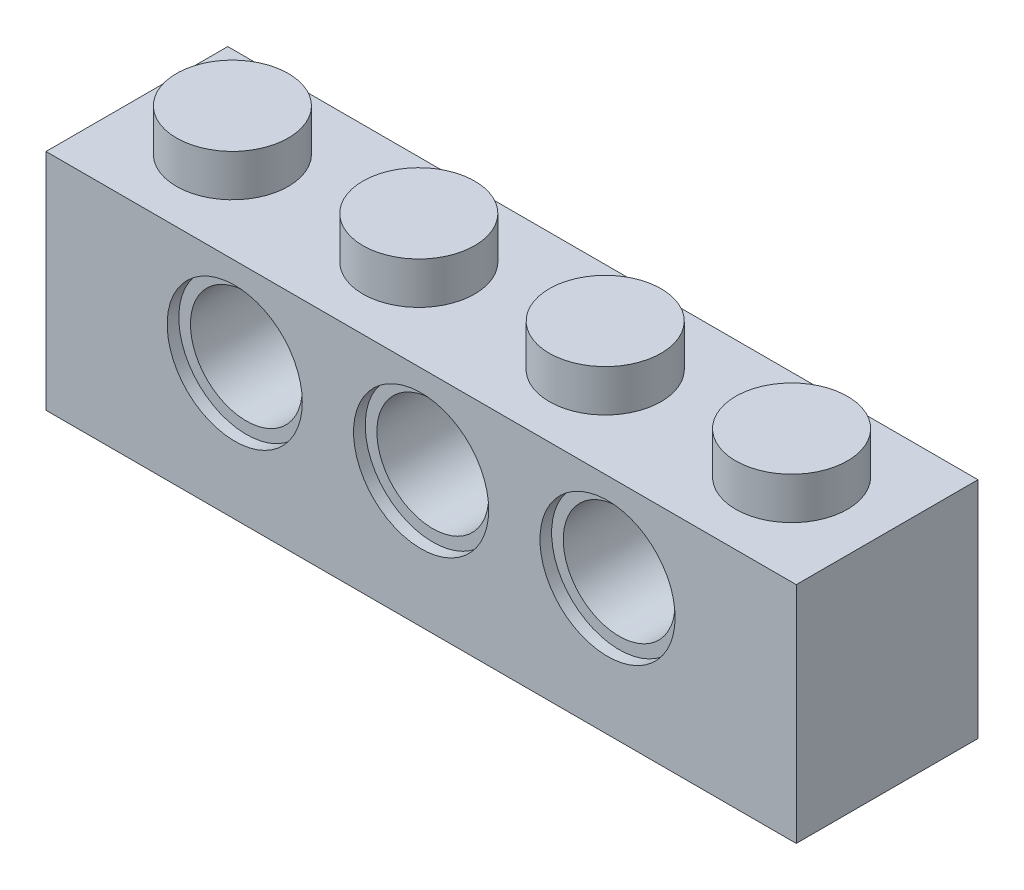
ISO-10303-21;
HEADER;
FILE_DESCRIPTION(('STEP AP214'),'2;1');
FILE_NAME('part.step','',(''),(''),'','','');
FILE_SCHEMA(('AUTOMOTIVE_DESIGN { 1 0 10303 214 1 1 1 1 }'));
ENDSEC;
DATA;
#1=APPLICATION_CONTEXT('core data for automotive mechanical design processes');
#2=APPLICATION_PROTOCOL_DEFINITION('international standard','automotive_design',2000,#1);
#3=PRODUCT_CONTEXT('',#1,'mechanical');
#4=PRODUCT('Part','Part','',(#3));
#5=PRODUCT_RELATED_PRODUCT_CATEGORY('part','',(#4));
#6=PRODUCT_DEFINITION_FORMATION('','',#4);
#7=PRODUCT_DEFINITION_CONTEXT('part definition',#1,'design');
#8=PRODUCT_DEFINITION('design','',#6,#7);
#9=PRODUCT_DEFINITION_SHAPE('','',#8);
#10=(LENGTH_UNIT() NAMED_UNIT(*) SI_UNIT(.MILLI.,.METRE.));
#11=(NAMED_UNIT(*) PLANE_ANGLE_UNIT() SI_UNIT($,.RADIAN.));
#12=(NAMED_UNIT(*) SI_UNIT($,.STERADIAN.) SOLID_ANGLE_UNIT());
#13=UNCERTAINTY_MEASURE_WITH_UNIT(LENGTH_MEASURE(1.E-05),#10,'distance_accuracy_value','');
#14=(GEOMETRIC_REPRESENTATION_CONTEXT(3) GLOBAL_UNCERTAINTY_ASSIGNED_CONTEXT((#13)) GLOBAL_UNIT_ASSIGNED_CONTEXT((#10,
#11,#12)) REPRESENTATION_CONTEXT('',''));
#15=CARTESIAN_POINT('',(0.,0.,0.));
#16=DIRECTION('',(0.,0.,1.));
#17=DIRECTION('',(1.,0.,0.));
#18=AXIS2_PLACEMENT_3D('',#15,#16,#17);
#19=CARTESIAN_POINT('',(-16.1,9.62,-3.9));
#20=DIRECTION('',(0.,1.,0.));
#21=DIRECTION('',(0.,0.,1.));
#22=AXIS2_PLACEMENT_3D('',#19,#20,#21);
#23=PLANE('',#22);
#24=CARTESIAN_POINT('',(-4.00000000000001,9.62,0.));
#25=DIRECTION('',(0.,1.,0.));
#26=DIRECTION('',(0.,0.,1.));
#27=AXIS2_PLACEMENT_3D('',#24,#25,#26);
#28=CIRCLE('',#27,2.4);
#29=CARTESIAN_POINT('',(-4.00000000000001,9.62,2.4));
#30=VERTEX_POINT('',#29);
#31=EDGE_CURVE('E487',#30,#30,#28,.T.);
#32=ORIENTED_EDGE('',*,*,#31,.F.);
#33=EDGE_LOOP('',(#32));
#34=FACE_BOUND('',#33,.T.);
#35=CARTESIAN_POINT('',(12.,9.62,0.));
#36=DIRECTION('',(0.,1.,0.));
#37=DIRECTION('',(0.,0.,1.));
#38=AXIS2_PLACEMENT_3D('',#35,#36,#37);
#39=CIRCLE('',#38,2.4);
#40=CARTESIAN_POINT('',(12.,9.62,2.4));
#41=VERTEX_POINT('',#40);
#42=EDGE_CURVE('E498',#41,#41,#39,.T.);
#43=ORIENTED_EDGE('',*,*,#42,.F.);
#44=EDGE_LOOP('',(#43));
#45=FACE_BOUND('',#44,.T.);
#46=DIRECTION('',(0.,0.,1.));
#47=VECTOR('',#46,1.);
#48=CARTESIAN_POINT('',(-16.1,9.62,3.9));
#49=LINE('',#48,#47);
#50=CARTESIAN_POINT('',(-16.1,9.62,-3.9));
#51=VERTEX_POINT('',#50);
#52=CARTESIAN_POINT('',(-16.1,9.62,3.9));
#53=VERTEX_POINT('',#52);
#54=EDGE_CURVE('E300',#51,#53,#49,.T.);
#55=ORIENTED_EDGE('',*,*,#54,.T.);
#56=DIRECTION('',(1.,0.,0.));
#57=VECTOR('',#56,1.);
#58=CARTESIAN_POINT('',(16.1,9.62,3.9));
#59=LINE('',#58,#57);
#60=CARTESIAN_POINT('',(16.1,9.62,3.9));
#61=VERTEX_POINT('',#60);
#62=EDGE_CURVE('E87',#53,#61,#59,.T.);
#63=ORIENTED_EDGE('',*,*,#62,.T.);
#64=DIRECTION('',(0.,0.,-1.));
#65=VECTOR('',#64,1.);
#66=CARTESIAN_POINT('',(16.1,9.62,3.9));
#67=LINE('',#66,#65);
#68=CARTESIAN_POINT('',(16.1,9.62,-3.9));
#69=VERTEX_POINT('',#68);
#70=EDGE_CURVE('E303',#61,#69,#67,.T.);
#71=ORIENTED_EDGE('',*,*,#70,.T.);
#72=DIRECTION('',(-1.,0.,0.));
#73=VECTOR('',#72,1.);
#74=CARTESIAN_POINT('',(16.1,9.62,-3.9));
#75=LINE('',#74,#73);
#76=EDGE_CURVE('E58',#69,#51,#75,.T.);
#77=ORIENTED_EDGE('',*,*,#76,.T.);
#78=EDGE_LOOP('',(#55,#63,#71,#77));
#79=FACE_BOUND('',#78,.T.);
#80=CARTESIAN_POINT('',(4.,9.62,0.));
#81=DIRECTION('',(0.,1.,0.));
#82=DIRECTION('',(0.,0.,1.));
#83=AXIS2_PLACEMENT_3D('',#80,#81,#82);
#84=CIRCLE('',#83,2.4);
#85=CARTESIAN_POINT('',(4.,9.62,2.4));
#86=VERTEX_POINT('',#85);
#87=EDGE_CURVE('E479',#86,#86,#84,.T.);
#88=ORIENTED_EDGE('',*,*,#87,.F.);
#89=EDGE_LOOP('',(#88));
#90=FACE_BOUND('',#89,.T.);
#91=CARTESIAN_POINT('',(-12.,9.62,0.));
#92=DIRECTION('',(0.,1.,0.));
#93=DIRECTION('',(0.,0.,1.));
#94=AXIS2_PLACEMENT_3D('',#91,#92,#93);
#95=CIRCLE('',#94,2.4);
#96=CARTESIAN_POINT('',(-12.,9.62,2.4));
#97=VERTEX_POINT('',#96);
#98=EDGE_CURVE('E482',#97,#97,#95,.T.);
#99=ORIENTED_EDGE('',*,*,#98,.F.);
#100=EDGE_LOOP('',(#99));
#101=FACE_BOUND('',#100,.T.);
#102=ADVANCED_FACE('F34',(#34,#45,#79,#90,#101),#23,.T.);
#103=CARTESIAN_POINT('',(-8.,5.8,-3.9));
#104=DIRECTION('',(0.,0.,1.));
#105=DIRECTION('',(1.,0.,0.));
#106=AXIS2_PLACEMENT_3D('',#103,#104,#105);
#107=CYLINDRICAL_SURFACE('',#106,2.9);
#108=CARTESIAN_POINT('',(-8.,5.8,2.9));
#109=DIRECTION('',(0.,0.,1.));
#110=DIRECTION('',(1.,0.,0.));
#111=AXIS2_PLACEMENT_3D('',#108,#109,#110);
#112=CIRCLE('',#111,2.9);
#113=CARTESIAN_POINT('',(-5.1,5.8,2.9));
#114=VERTEX_POINT('',#113);
#115=EDGE_CURVE('E219',#114,#114,#112,.F.);
#116=ORIENTED_EDGE('',*,*,#115,.T.);
#117=EDGE_LOOP('',(#116));
#118=FACE_BOUND('',#117,.T.);
#119=CARTESIAN_POINT('',(-8.,5.8,-2.9));
#120=DIRECTION('',(0.,0.,-1.));
#121=DIRECTION('',(-1.,0.,0.));
#122=AXIS2_PLACEMENT_3D('',#119,#120,#121);
#123=CIRCLE('',#122,2.9);
#124=CARTESIAN_POINT('',(-10.9,5.8,-2.9));
#125=VERTEX_POINT('',#124);
#126=EDGE_CURVE('E558',#125,#125,#123,.F.);
#127=ORIENTED_EDGE('',*,*,#126,.T.);
#128=EDGE_LOOP('',(#127));
#129=FACE_BOUND('',#128,.T.);
#130=CARTESIAN_POINT('',(-8.,2.90000000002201,-1.6));
#131=CARTESIAN_POINT('',(-7.921471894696,2.90000448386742,-1.59999490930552));
#132=CARTESIAN_POINT('',(-7.84286011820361,2.90322330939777,-1.59379724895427));
#133=CARTESIAN_POINT('',(-7.68798079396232,2.91578284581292,-1.56929063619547));
#134=CARTESIAN_POINT('',(-7.61171751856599,2.92513409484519,-1.55096083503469));
#135=CARTESIAN_POINT('',(-7.46400769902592,2.94898464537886,-1.50310927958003));
#136=CARTESIAN_POINT('',(-7.39254333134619,2.96346348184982,-1.47363198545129));
#137=CARTESIAN_POINT('',(-7.25569207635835,2.99625882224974,-1.40456376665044));
#138=CARTESIAN_POINT('',(-7.19030497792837,3.01457519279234,-1.36497319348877));
#139=CARTESIAN_POINT('',(-7.06280074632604,3.05474878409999,-1.27395765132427));
#140=CARTESIAN_POINT('',(-7.00115400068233,3.07675689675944,-1.22194137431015));
#141=CARTESIAN_POINT('',(-6.88702119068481,3.12137342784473,-1.10883219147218));
#142=CARTESIAN_POINT('',(-6.8345426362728,3.14398232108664,-1.0477319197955));
#143=CARTESIAN_POINT('',(-6.73578002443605,3.18945452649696,-0.912016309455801));
#144=CARTESIAN_POINT('',(-6.69039336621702,3.21217808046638,-0.836695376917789));
#145=CARTESIAN_POINT('',(-6.61312100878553,3.25274983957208,-0.678205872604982));
#146=CARTESIAN_POINT('',(-6.58122521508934,3.27060168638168,-0.595043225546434));
#147=CARTESIAN_POINT('',(-6.53399269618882,3.29769543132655,-0.428402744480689));
#148=CARTESIAN_POINT('',(-6.51775896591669,3.30739894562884,-0.345258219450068));
#149=CARTESIAN_POINT('',(-6.49958968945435,3.31828794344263,-0.176907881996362));
#150=CARTESIAN_POINT('',(-6.49763812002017,3.319482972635,-0.0917044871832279));
#151=CARTESIAN_POINT('',(-6.50743269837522,3.31358591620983,0.0663942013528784));
#152=CARTESIAN_POINT('',(-6.51742837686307,3.30755262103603,0.139447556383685));
#153=CARTESIAN_POINT('',(-6.54777935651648,3.28974867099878,0.282641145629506));
#154=CARTESIAN_POINT('',(-6.56813837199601,3.27797595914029,0.352780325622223));
#155=CARTESIAN_POINT('',(-6.61898268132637,3.24977482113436,0.490155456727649));
#156=CARTESIAN_POINT('',(-6.64969025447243,3.23324547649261,0.557287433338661));
#157=CARTESIAN_POINT('',(-6.72018381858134,3.19737955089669,0.685777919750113));
#158=CARTESIAN_POINT('',(-6.75997388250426,3.17804171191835,0.747133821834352));
#159=CARTESIAN_POINT('',(-6.85384832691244,3.13554193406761,0.871177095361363));
#160=CARTESIAN_POINT('',(-6.90914408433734,3.11221899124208,0.932895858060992));
#161=CARTESIAN_POINT('',(-7.02935669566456,3.06650616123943,1.04660430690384));
#162=CARTESIAN_POINT('',(-7.09427874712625,3.04411678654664,1.09858870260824));
#163=CARTESIAN_POINT('',(-7.23622643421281,3.00135346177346,1.19396135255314));
#164=CARTESIAN_POINT('',(-7.31371076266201,2.98114885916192,1.23674915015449));
#165=CARTESIAN_POINT('',(-7.47608409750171,2.94651444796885,1.30831980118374));
#166=CARTESIAN_POINT('',(-7.56096677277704,2.93207975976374,1.33711449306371));
#167=CARTESIAN_POINT('',(-7.72785615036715,2.91168151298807,1.37738154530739));
#168=CARTESIAN_POINT('',(-7.80947582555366,2.90509285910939,1.39013755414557));
#169=CARTESIAN_POINT('',(-7.97394938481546,2.898952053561,1.40203479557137));
#170=CARTESIAN_POINT('',(-8.05680259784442,2.89939620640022,1.40118317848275));
#171=CARTESIAN_POINT('',(-8.21395857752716,2.90692330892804,1.38658101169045));
#172=CARTESIAN_POINT('',(-8.2883939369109,2.91344417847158,1.37392248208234));
#173=CARTESIAN_POINT('',(-8.43391892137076,2.93170880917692,1.33782340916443));
#174=CARTESIAN_POINT('',(-8.50500818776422,2.9434531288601,1.31438171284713));
#175=CARTESIAN_POINT('',(-8.64405928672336,2.97150969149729,1.25683609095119));
#176=CARTESIAN_POINT('',(-8.71188548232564,2.98793635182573,1.22246222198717));
#177=CARTESIAN_POINT('',(-8.84101810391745,3.02381790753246,1.14434327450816));
#178=CARTESIAN_POINT('',(-8.90232184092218,3.04327404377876,1.10059435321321));
#179=CARTESIAN_POINT('',(-9.02339228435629,3.08574208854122,0.999771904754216));
#180=CARTESIAN_POINT('',(-9.0823468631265,3.1089137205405,0.941789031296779));
#181=CARTESIAN_POINT('',(-9.19008310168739,3.15478961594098,0.816797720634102));
#182=CARTESIAN_POINT('',(-9.23885649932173,3.17749348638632,0.749782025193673));
#183=CARTESIAN_POINT('',(-9.32754748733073,3.22120104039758,0.603792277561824));
#184=CARTESIAN_POINT('',(-9.36678932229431,3.24203032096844,0.524350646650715));
#185=CARTESIAN_POINT('',(-9.43093282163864,3.27734464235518,0.358585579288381));
#186=CARTESIAN_POINT('',(-9.45585409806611,3.29183835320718,0.272271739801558));
#187=CARTESIAN_POINT('',(-9.48825473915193,3.31093982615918,0.104183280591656));
#188=CARTESIAN_POINT('',(-9.49719888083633,3.31637430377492,0.0227876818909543));
#189=CARTESIAN_POINT('',(-9.50167206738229,3.31907405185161,-0.140489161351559));
#190=CARTESIAN_POINT('',(-9.49720844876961,3.31634378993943,-0.222370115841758));
#191=CARTESIAN_POINT('',(-9.47638457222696,3.30392226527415,-0.374894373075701));
#192=CARTESIAN_POINT('',(-9.4613661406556,3.29501752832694,-0.445793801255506));
#193=CARTESIAN_POINT('',(-9.42160184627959,3.27224011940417,-0.583962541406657));
#194=CARTESIAN_POINT('',(-9.39685264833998,3.25836574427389,-0.651230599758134));
#195=CARTESIAN_POINT('',(-9.33651378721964,3.22609791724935,-0.785187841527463));
#196=CARTESIAN_POINT('',(-9.30031422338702,3.20746584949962,-0.851542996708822));
#197=CARTESIAN_POINT('',(-9.21874055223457,3.16813341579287,-0.977678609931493));
#198=CARTESIAN_POINT('',(-9.17336153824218,3.14743194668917,-1.03745552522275));
#199=CARTESIAN_POINT('',(-9.06764370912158,3.1029937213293,-1.15703547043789));
#200=CARTESIAN_POINT('',(-9.0061172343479,3.07922007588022,-1.21578062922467));
#201=CARTESIAN_POINT('',(-8.87349538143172,3.03379018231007,-1.32239310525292));
#202=CARTESIAN_POINT('',(-8.8023944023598,3.01213518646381,-1.37025401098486));
#203=CARTESIAN_POINT('',(-8.65096613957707,2.97290760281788,-1.45419732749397));
#204=CARTESIAN_POINT('',(-8.57051424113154,2.95540260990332,-1.49008814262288));
#205=CARTESIAN_POINT('',(-8.40362630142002,2.92698858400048,-1.54734915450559));
#206=CARTESIAN_POINT('',(-8.31720750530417,2.91606136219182,-1.56875941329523));
#207=CARTESIAN_POINT('',(-8.19152052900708,2.90607889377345,-1.58821968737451));
#208=CARTESIAN_POINT('',(-8.15339338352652,2.90380619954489,-1.59263005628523));
#209=CARTESIAN_POINT('',(-8.07685084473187,2.90076563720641,-1.59852149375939));
#210=CARTESIAN_POINT('',(-8.03843544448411,2.89999780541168,-1.60000249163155));
#211=CARTESIAN_POINT('',(-8.,2.90000000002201,-1.6));
#212=B_SPLINE_CURVE_WITH_KNOTS('',3,(#130,#131,#132,#133,#134,#135,#136,#137,#138,#139,#140,
#141,#142,#143,#144,#145,#146,#147,#148,#149,#150,#151,#152,#153,#154,#155,#156,#157,#158,#159,
#160,#161,#162,#163,#164,#165,#166,#167,#168,#169,#170,#171,#172,#173,#174,#175,#176,#177,#178,
#179,#180,#181,#182,#183,#184,#185,#186,#187,#188,#189,#190,#191,#192,#193,#194,#195,#196,#197,
#198,#199,#200,#201,#202,#203,#204,#205,#206,#207,#208,#209,#210,#211),.UNSPECIFIED.,.T.,.F.,(4,
2,2,2,2,2,2,2,2,2,2,2,2,2,2,2,2,2,2,2,2,2,2,2,2,2,2,2,2,2,2,2,2,2,2,2,2,2,2,2,4),(0.,
0.235428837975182,0.471263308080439,0.706166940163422,0.941062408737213,1.19085521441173,
1.44085168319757,1.71196047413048,1.98286604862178,2.23712678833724,2.49110222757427,
2.71200795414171,2.93299291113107,3.15906400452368,3.38523667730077,3.64238669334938,
3.89967606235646,4.17058054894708,4.44125544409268,4.68850125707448,4.93561715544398,
5.16192793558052,5.38826291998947,5.62068853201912,5.85320959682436,6.10973677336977,
6.36647132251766,6.63806187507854,6.90927959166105,7.15402989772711,7.39864630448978,
7.61675046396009,7.83492944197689,8.06757275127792,8.3003407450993,8.56412475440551,
8.82806374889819,9.09604461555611,9.36328101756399,9.47850847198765,9.59373870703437),.UNSPECIFIED.);
#213=CARTESIAN_POINT('',(-8.,2.90000000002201,-1.6));
#214=VERTEX_POINT('',#213);
#215=EDGE_CURVE('E503',#214,#214,#212,.T.);
#216=ORIENTED_EDGE('',*,*,#215,.F.);
#217=EDGE_LOOP('',(#216));
#218=FACE_BOUND('',#217,.T.);
#219=ADVANCED_FACE('F396',(#118,#129,#218),#107,.T.);
#220=CARTESIAN_POINT('',(8.,5.8,-3.9));
#221=DIRECTION('',(0.,0.,1.));
#222=DIRECTION('',(1.,0.,0.));
#223=AXIS2_PLACEMENT_3D('',#220,#221,#222);
#224=CYLINDRICAL_SURFACE('',#223,2.9);
#225=CARTESIAN_POINT('',(8.,5.8,2.9));
#226=DIRECTION('',(0.,0.,1.));
#227=DIRECTION('',(1.,0.,0.));
#228=AXIS2_PLACEMENT_3D('',#225,#226,#227);
#229=CIRCLE('',#228,2.9);
#230=CARTESIAN_POINT('',(10.9,5.8,2.9));
#231=VERTEX_POINT('',#230);
#232=EDGE_CURVE('E576',#231,#231,#229,.F.);
#233=ORIENTED_EDGE('',*,*,#232,.T.);
#234=EDGE_LOOP('',(#233));
#235=FACE_BOUND('',#234,.T.);
#236=CARTESIAN_POINT('',(8.,5.8,-2.9));
#237=DIRECTION('',(0.,0.,-1.));
#238=DIRECTION('',(-1.,0.,0.));
#239=AXIS2_PLACEMENT_3D('',#236,#237,#238);
#240=CIRCLE('',#239,2.9);
#241=CARTESIAN_POINT('',(5.1,5.8,-2.9));
#242=VERTEX_POINT('',#241);
#243=EDGE_CURVE('E573',#242,#242,#240,.F.);
#244=ORIENTED_EDGE('',*,*,#243,.T.);
#245=EDGE_LOOP('',(#244));
#246=FACE_BOUND('',#245,.T.);
#247=CARTESIAN_POINT('',(8.,2.90000000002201,-1.6));
#248=CARTESIAN_POINT('',(8.078528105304,2.90000448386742,-1.59999490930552));
#249=CARTESIAN_POINT('',(8.15713988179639,2.90322330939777,-1.59379724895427));
#250=CARTESIAN_POINT('',(8.31201920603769,2.91578284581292,-1.56929063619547));
#251=CARTESIAN_POINT('',(8.38828248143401,2.92513409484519,-1.55096083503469));
#252=CARTESIAN_POINT('',(8.53599230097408,2.94898464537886,-1.50310927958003));
#253=CARTESIAN_POINT('',(8.60745666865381,2.96346348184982,-1.47363198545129));
#254=CARTESIAN_POINT('',(8.74430792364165,2.99625882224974,-1.40456376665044));
#255=CARTESIAN_POINT('',(8.80969502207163,3.01457519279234,-1.36497319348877));
#256=CARTESIAN_POINT('',(8.93719925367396,3.05474878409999,-1.27395765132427));
#257=CARTESIAN_POINT('',(8.99884599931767,3.07675689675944,-1.22194137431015));
#258=CARTESIAN_POINT('',(9.11297880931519,3.12137342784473,-1.10883219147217));
#259=CARTESIAN_POINT('',(9.1654573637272,3.14398232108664,-1.0477319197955));
#260=CARTESIAN_POINT('',(9.26421997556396,3.18945452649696,-0.912016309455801));
#261=CARTESIAN_POINT('',(9.30960663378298,3.21217808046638,-0.836695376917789));
#262=CARTESIAN_POINT('',(9.38687899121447,3.25274983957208,-0.678205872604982));
#263=CARTESIAN_POINT('',(9.41877478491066,3.27060168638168,-0.595043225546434));
#264=CARTESIAN_POINT('',(9.46600730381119,3.29769543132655,-0.42840274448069));
#265=CARTESIAN_POINT('',(9.48224103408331,3.30739894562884,-0.345258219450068));
#266=CARTESIAN_POINT('',(9.50041031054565,3.31828794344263,-0.176907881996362));
#267=CARTESIAN_POINT('',(9.50236187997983,3.319482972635,-0.091704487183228));
#268=CARTESIAN_POINT('',(9.49256730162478,3.31358591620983,0.0663942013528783));
#269=CARTESIAN_POINT('',(9.48257162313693,3.30755262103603,0.139447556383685));
#270=CARTESIAN_POINT('',(9.45222064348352,3.28974867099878,0.282641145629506));
#271=CARTESIAN_POINT('',(9.43186162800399,3.27797595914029,0.352780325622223));
#272=CARTESIAN_POINT('',(9.38101731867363,3.24977482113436,0.490155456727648));
#273=CARTESIAN_POINT('',(9.35030974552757,3.23324547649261,0.557287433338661));
#274=CARTESIAN_POINT('',(9.27981618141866,3.19737955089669,0.685777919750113));
#275=CARTESIAN_POINT('',(9.24002611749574,3.17804171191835,0.747133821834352));
#276=CARTESIAN_POINT('',(9.14615167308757,3.13554193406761,0.871177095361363));
#277=CARTESIAN_POINT('',(9.09085591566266,3.11221899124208,0.932895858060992));
#278=CARTESIAN_POINT('',(8.97064330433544,3.06650616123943,1.04660430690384));
#279=CARTESIAN_POINT('',(8.90572125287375,3.04411678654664,1.09858870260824));
#280=CARTESIAN_POINT('',(8.76377356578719,3.00135346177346,1.19396135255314));
#281=CARTESIAN_POINT('',(8.68628923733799,2.98114885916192,1.23674915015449));
#282=CARTESIAN_POINT('',(8.52391590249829,2.94651444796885,1.30831980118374));
#283=CARTESIAN_POINT('',(8.43903322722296,2.93207975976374,1.33711449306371));
#284=CARTESIAN_POINT('',(8.27214384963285,2.91168151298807,1.37738154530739));
#285=CARTESIAN_POINT('',(8.19052417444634,2.90509285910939,1.39013755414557));
#286=CARTESIAN_POINT('',(8.02605061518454,2.898952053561,1.40203479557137));
#287=CARTESIAN_POINT('',(7.94319740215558,2.89939620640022,1.40118317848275));
#288=CARTESIAN_POINT('',(7.78604142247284,2.90692330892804,1.38658101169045));
#289=CARTESIAN_POINT('',(7.7116060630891,2.91344417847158,1.37392248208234));
#290=CARTESIAN_POINT('',(7.56608107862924,2.93170880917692,1.33782340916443));
#291=CARTESIAN_POINT('',(7.49499181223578,2.9434531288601,1.31438171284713));
#292=CARTESIAN_POINT('',(7.35594071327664,2.97150969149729,1.25683609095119));
#293=CARTESIAN_POINT('',(7.28811451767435,2.98793635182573,1.22246222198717));
#294=CARTESIAN_POINT('',(7.15898189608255,3.02381790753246,1.14434327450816));
#295=CARTESIAN_POINT('',(7.09767815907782,3.04327404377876,1.10059435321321));
#296=CARTESIAN_POINT('',(6.97660771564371,3.08574208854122,0.999771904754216));
#297=CARTESIAN_POINT('',(6.9176531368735,3.1089137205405,0.941789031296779));
#298=CARTESIAN_POINT('',(6.80991689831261,3.15478961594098,0.816797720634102));
#299=CARTESIAN_POINT('',(6.76114350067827,3.17749348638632,0.749782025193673));
#300=CARTESIAN_POINT('',(6.67245251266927,3.22120104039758,0.603792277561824));
#301=CARTESIAN_POINT('',(6.6332106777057,3.24203032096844,0.524350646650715));
#302=CARTESIAN_POINT('',(6.56906717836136,3.27734464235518,0.358585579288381));
#303=CARTESIAN_POINT('',(6.54414590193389,3.29183835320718,0.272271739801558));
#304=CARTESIAN_POINT('',(6.51174526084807,3.31093982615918,0.104183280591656));
#305=CARTESIAN_POINT('',(6.50280111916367,3.31637430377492,0.0227876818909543));
#306=CARTESIAN_POINT('',(6.49832793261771,3.31907405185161,-0.140489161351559));
#307=CARTESIAN_POINT('',(6.50279155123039,3.31634378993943,-0.222370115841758));
#308=CARTESIAN_POINT('',(6.52361542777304,3.30392226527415,-0.374894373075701));
#309=CARTESIAN_POINT('',(6.5386338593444,3.29501752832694,-0.445793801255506));
#310=CARTESIAN_POINT('',(6.57839815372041,3.27224011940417,-0.583962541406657));
#311=CARTESIAN_POINT('',(6.60314735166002,3.25836574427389,-0.651230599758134));
#312=CARTESIAN_POINT('',(6.66348621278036,3.22609791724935,-0.785187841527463));
#313=CARTESIAN_POINT('',(6.69968577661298,3.20746584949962,-0.851542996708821));
#314=CARTESIAN_POINT('',(6.78125944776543,3.16813341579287,-0.977678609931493));
#315=CARTESIAN_POINT('',(6.82663846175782,3.14743194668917,-1.03745552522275));
#316=CARTESIAN_POINT('',(6.93235629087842,3.1029937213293,-1.15703547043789));
#317=CARTESIAN_POINT('',(6.9938827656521,3.07922007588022,-1.21578062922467));
#318=CARTESIAN_POINT('',(7.12650461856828,3.03379018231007,-1.32239310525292));
#319=CARTESIAN_POINT('',(7.1976055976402,3.01213518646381,-1.37025401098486));
#320=CARTESIAN_POINT('',(7.34903386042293,2.97290760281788,-1.45419732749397));
#321=CARTESIAN_POINT('',(7.42948575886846,2.95540260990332,-1.49008814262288));
#322=CARTESIAN_POINT('',(7.59637369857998,2.92698858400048,-1.54734915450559));
#323=CARTESIAN_POINT('',(7.68279249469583,2.91606136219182,-1.56875941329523));
#324=CARTESIAN_POINT('',(7.80847947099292,2.90607889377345,-1.58821968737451));
#325=CARTESIAN_POINT('',(7.84660661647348,2.90380619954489,-1.59263005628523));
#326=CARTESIAN_POINT('',(7.92314915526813,2.90076563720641,-1.59852149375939));
#327=CARTESIAN_POINT('',(7.96156455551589,2.89999780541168,-1.60000249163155));
#328=CARTESIAN_POINT('',(8.,2.90000000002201,-1.6));
#329=B_SPLINE_CURVE_WITH_KNOTS('',3,(#247,#248,#249,#250,#251,#252,#253,#254,#255,#256,#257,
#258,#259,#260,#261,#262,#263,#264,#265,#266,#267,#268,#269,#270,#271,#272,#273,#274,#275,#276,
#277,#278,#279,#280,#281,#282,#283,#284,#285,#286,#287,#288,#289,#290,#291,#292,#293,#294,#295,
#296,#297,#298,#299,#300,#301,#302,#303,#304,#305,#306,#307,#308,#309,#310,#311,#312,#313,#314,
#315,#316,#317,#318,#319,#320,#321,#322,#323,#324,#325,#326,#327,#328),.UNSPECIFIED.,.T.,.F.,(4,
2,2,2,2,2,2,2,2,2,2,2,2,2,2,2,2,2,2,2,2,2,2,2,2,2,2,2,2,2,2,2,2,2,2,2,2,2,2,2,4),(0.,
0.235428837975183,0.47126330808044,0.706166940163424,0.941062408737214,1.19085521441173,
1.44085168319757,1.71196047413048,1.98286604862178,2.23712678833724,2.49110222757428,
2.71200795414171,2.93299291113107,3.15906400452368,3.38523667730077,3.64238669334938,
3.89967606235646,4.17058054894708,4.44125544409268,4.68850125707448,4.93561715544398,
5.16192793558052,5.38826291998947,5.62068853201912,5.85320959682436,6.10973677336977,
6.36647132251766,6.63806187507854,6.90927959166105,7.15402989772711,7.39864630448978,
7.61675046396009,7.83492944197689,8.06757275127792,8.3003407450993,8.56412475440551,
8.82806374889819,9.09604461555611,9.363281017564,9.47850847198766,9.59373870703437),.UNSPECIFIED.);
#330=CARTESIAN_POINT('',(8.,2.90000000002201,-1.6));
#331=VERTEX_POINT('',#330);
#332=EDGE_CURVE('E529',#331,#331,#329,.T.);
#333=ORIENTED_EDGE('',*,*,#332,.F.);
#334=EDGE_LOOP('',(#333));
#335=FACE_BOUND('',#334,.T.);
#336=ADVANCED_FACE('F402',(#235,#246,#335),#224,.T.);
#337=CARTESIAN_POINT('',(0.,5.8,-3.9));
#338=DIRECTION('',(0.,0.,1.));
#339=DIRECTION('',(1.,0.,0.));
#340=AXIS2_PLACEMENT_3D('',#337,#338,#339);
#341=CYLINDRICAL_SURFACE('',#340,2.9);
#342=CARTESIAN_POINT('',(0.,5.8,2.9));
#343=DIRECTION('',(0.,0.,1.));
#344=DIRECTION('',(1.,0.,0.));
#345=AXIS2_PLACEMENT_3D('',#342,#343,#344);
#346=CIRCLE('',#345,2.9);
#347=CARTESIAN_POINT('',(2.9,5.8,2.9));
#348=VERTEX_POINT('',#347);
#349=EDGE_CURVE('E228',#348,#348,#346,.F.);
#350=ORIENTED_EDGE('',*,*,#349,.T.);
#351=EDGE_LOOP('',(#350));
#352=FACE_BOUND('',#351,.T.);
#353=CARTESIAN_POINT('',(0.,5.8,-2.9));
#354=DIRECTION('',(0.,0.,-1.));
#355=DIRECTION('',(-1.,0.,0.));
#356=AXIS2_PLACEMENT_3D('',#353,#354,#355);
#357=CIRCLE('',#356,2.9);
#358=CARTESIAN_POINT('',(-2.9,5.8,-2.9));
#359=VERTEX_POINT('',#358);
#360=EDGE_CURVE('E232',#359,#359,#357,.F.);
#361=ORIENTED_EDGE('',*,*,#360,.T.);
#362=EDGE_LOOP('',(#361));
#363=FACE_BOUND('',#362,.T.);
#364=CARTESIAN_POINT('',(0.,2.90000000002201,-1.6));
#365=CARTESIAN_POINT('',(0.0785281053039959,2.90000448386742,-1.59999490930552));
#366=CARTESIAN_POINT('',(0.157139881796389,2.90322330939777,-1.59379724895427));
#367=CARTESIAN_POINT('',(0.312019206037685,2.91578284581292,-1.56929063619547));
#368=CARTESIAN_POINT('',(0.388282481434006,2.92513409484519,-1.55096083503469));
#369=CARTESIAN_POINT('',(0.535992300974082,2.94898464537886,-1.50310927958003));
#370=CARTESIAN_POINT('',(0.607456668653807,2.96346348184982,-1.47363198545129));
#371=CARTESIAN_POINT('',(0.744307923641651,2.99625882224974,-1.40456376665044));
#372=CARTESIAN_POINT('',(0.80969502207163,3.01457519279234,-1.36497319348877));
#373=CARTESIAN_POINT('',(0.937199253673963,3.05474878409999,-1.27395765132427));
#374=CARTESIAN_POINT('',(0.998845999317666,3.07675689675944,-1.22194137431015));
#375=CARTESIAN_POINT('',(1.11297880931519,3.12137342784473,-1.10883219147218));
#376=CARTESIAN_POINT('',(1.1654573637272,3.14398232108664,-1.0477319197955));
#377=CARTESIAN_POINT('',(1.26421997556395,3.18945452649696,-0.912016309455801));
#378=CARTESIAN_POINT('',(1.30960663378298,3.21217808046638,-0.836695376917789));
#379=CARTESIAN_POINT('',(1.38687899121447,3.25274983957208,-0.678205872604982));
#380=CARTESIAN_POINT('',(1.41877478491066,3.27060168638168,-0.595043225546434));
#381=CARTESIAN_POINT('',(1.46600730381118,3.29769543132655,-0.428402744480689));
#382=CARTESIAN_POINT('',(1.48224103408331,3.30739894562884,-0.345258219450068));
#383=CARTESIAN_POINT('',(1.50041031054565,3.31828794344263,-0.176907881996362));
#384=CARTESIAN_POINT('',(1.50236187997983,3.319482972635,-0.091704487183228));
#385=CARTESIAN_POINT('',(1.49256730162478,3.31358591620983,0.0663942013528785));
#386=CARTESIAN_POINT('',(1.48257162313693,3.30755262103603,0.139447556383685));
#387=CARTESIAN_POINT('',(1.45222064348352,3.28974867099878,0.282641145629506));
#388=CARTESIAN_POINT('',(1.43186162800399,3.27797595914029,0.352780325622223));
#389=CARTESIAN_POINT('',(1.38101731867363,3.24977482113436,0.490155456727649));
#390=CARTESIAN_POINT('',(1.35030974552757,3.23324547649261,0.557287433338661));
#391=CARTESIAN_POINT('',(1.27981618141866,3.19737955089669,0.685777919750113));
#392=CARTESIAN_POINT('',(1.24002611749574,3.17804171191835,0.747133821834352));
#393=CARTESIAN_POINT('',(1.14615167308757,3.13554193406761,0.871177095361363));
#394=CARTESIAN_POINT('',(1.09085591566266,3.11221899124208,0.932895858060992));
#395=CARTESIAN_POINT('',(0.970643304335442,3.06650616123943,1.04660430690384));
#396=CARTESIAN_POINT('',(0.905721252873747,3.04411678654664,1.09858870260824));
#397=CARTESIAN_POINT('',(0.763773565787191,3.00135346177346,1.19396135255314));
#398=CARTESIAN_POINT('',(0.686289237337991,2.98114885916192,1.23674915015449));
#399=CARTESIAN_POINT('',(0.523915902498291,2.94651444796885,1.30831980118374));
#400=CARTESIAN_POINT('',(0.439033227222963,2.93207975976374,1.33711449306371));
#401=CARTESIAN_POINT('',(0.272143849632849,2.91168151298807,1.37738154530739));
#402=CARTESIAN_POINT('',(0.190524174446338,2.90509285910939,1.39013755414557));
#403=CARTESIAN_POINT('',(0.0260506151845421,2.898952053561,1.40203479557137));
#404=CARTESIAN_POINT('',(-0.0568025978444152,2.89939620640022,1.40118317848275));
#405=CARTESIAN_POINT('',(-0.213958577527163,2.90692330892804,1.38658101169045));
#406=CARTESIAN_POINT('',(-0.288393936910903,2.91344417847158,1.37392248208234));
#407=CARTESIAN_POINT('',(-0.433918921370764,2.93170880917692,1.33782340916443));
#408=CARTESIAN_POINT('',(-0.505008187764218,2.9434531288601,1.31438171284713));
#409=CARTESIAN_POINT('',(-0.644059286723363,2.97150969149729,1.25683609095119));
#410=CARTESIAN_POINT('',(-0.711885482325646,2.98793635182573,1.22246222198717));
#411=CARTESIAN_POINT('',(-0.841018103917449,3.02381790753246,1.14434327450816));
#412=CARTESIAN_POINT('',(-0.902321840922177,3.04327404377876,1.10059435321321));
#413=CARTESIAN_POINT('',(-1.02339228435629,3.08574208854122,0.999771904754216));
#414=CARTESIAN_POINT('',(-1.0823468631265,3.1089137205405,0.941789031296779));
#415=CARTESIAN_POINT('',(-1.19008310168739,3.15478961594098,0.816797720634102));
#416=CARTESIAN_POINT('',(-1.23885649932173,3.17749348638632,0.749782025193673));
#417=CARTESIAN_POINT('',(-1.32754748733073,3.22120104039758,0.603792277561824));
#418=CARTESIAN_POINT('',(-1.36678932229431,3.24203032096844,0.524350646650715));
#419=CARTESIAN_POINT('',(-1.43093282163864,3.27734464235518,0.358585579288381));
#420=CARTESIAN_POINT('',(-1.45585409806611,3.29183835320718,0.272271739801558));
#421=CARTESIAN_POINT('',(-1.48825473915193,3.31093982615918,0.104183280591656));
#422=CARTESIAN_POINT('',(-1.49719888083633,3.31637430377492,0.0227876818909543));
#423=CARTESIAN_POINT('',(-1.50167206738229,3.31907405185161,-0.140489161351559));
#424=CARTESIAN_POINT('',(-1.4972084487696,3.31634378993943,-0.222370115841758));
#425=CARTESIAN_POINT('',(-1.47638457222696,3.30392226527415,-0.374894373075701));
#426=CARTESIAN_POINT('',(-1.4613661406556,3.29501752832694,-0.445793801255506));
#427=CARTESIAN_POINT('',(-1.42160184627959,3.27224011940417,-0.583962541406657));
#428=CARTESIAN_POINT('',(-1.39685264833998,3.25836574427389,-0.651230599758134));
#429=CARTESIAN_POINT('',(-1.33651378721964,3.22609791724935,-0.785187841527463));
#430=CARTESIAN_POINT('',(-1.30031422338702,3.20746584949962,-0.851542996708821));
#431=CARTESIAN_POINT('',(-1.21874055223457,3.16813341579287,-0.977678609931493));
#432=CARTESIAN_POINT('',(-1.17336153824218,3.14743194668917,-1.03745552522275));
#433=CARTESIAN_POINT('',(-1.06764370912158,3.1029937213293,-1.15703547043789));
#434=CARTESIAN_POINT('',(-1.0061172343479,3.07922007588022,-1.21578062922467));
#435=CARTESIAN_POINT('',(-0.873495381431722,3.03379018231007,-1.32239310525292));
#436=CARTESIAN_POINT('',(-0.8023944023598,3.01213518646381,-1.37025401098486));
#437=CARTESIAN_POINT('',(-0.650966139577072,2.97290760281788,-1.45419732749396));
#438=CARTESIAN_POINT('',(-0.570514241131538,2.95540260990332,-1.49008814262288));
#439=CARTESIAN_POINT('',(-0.403626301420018,2.92698858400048,-1.54734915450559));
#440=CARTESIAN_POINT('',(-0.317207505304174,2.91606136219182,-1.56875941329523));
#441=CARTESIAN_POINT('',(-0.191520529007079,2.90607889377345,-1.58821968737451));
#442=CARTESIAN_POINT('',(-0.153393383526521,2.90380619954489,-1.59263005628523));
#443=CARTESIAN_POINT('',(-0.0768508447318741,2.90076563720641,-1.59852149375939));
#444=CARTESIAN_POINT('',(-0.0384354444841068,2.89999780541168,-1.60000249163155));
#445=CARTESIAN_POINT('',(0.,2.90000000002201,-1.6));
#446=B_SPLINE_CURVE_WITH_KNOTS('',3,(#364,#365,#366,#367,#368,#369,#370,#371,#372,#373,#374,
#375,#376,#377,#378,#379,#380,#381,#382,#383,#384,#385,#386,#387,#388,#389,#390,#391,#392,#393,
#394,#395,#396,#397,#398,#399,#400,#401,#402,#403,#404,#405,#406,#407,#408,#409,#410,#411,#412,
#413,#414,#415,#416,#417,#418,#419,#420,#421,#422,#423,#424,#425,#426,#427,#428,#429,#430,#431,
#432,#433,#434,#435,#436,#437,#438,#439,#440,#441,#442,#443,#444,#445),.UNSPECIFIED.,.T.,.F.,(4,
2,2,2,2,2,2,2,2,2,2,2,2,2,2,2,2,2,2,2,2,2,2,2,2,2,2,2,2,2,2,2,2,2,2,2,2,2,2,2,4),(0.,
0.235428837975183,0.471263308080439,0.706166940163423,0.941062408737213,1.19085521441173,
1.44085168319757,1.71196047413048,1.98286604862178,2.23712678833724,2.49110222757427,
2.71200795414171,2.93299291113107,3.15906400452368,3.38523667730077,3.64238669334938,
3.89967606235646,4.17058054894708,4.44125544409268,4.68850125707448,4.93561715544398,
5.16192793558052,5.38826291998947,5.62068853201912,5.85320959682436,6.10973677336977,
6.36647132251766,6.63806187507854,6.90927959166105,7.15402989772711,7.39864630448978,
7.61675046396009,7.83492944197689,8.06757275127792,8.3003407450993,8.56412475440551,
8.82806374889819,9.09604461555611,9.363281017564,9.47850847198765,9.59373870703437),.UNSPECIFIED.);
#447=CARTESIAN_POINT('',(0.,2.90000000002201,-1.6));
#448=VERTEX_POINT('',#447);
#449=EDGE_CURVE('E546',#448,#448,#446,.T.);
#450=ORIENTED_EDGE('',*,*,#449,.F.);
#451=EDGE_LOOP('',(#450));
#452=FACE_BOUND('',#451,.T.);
#453=ADVANCED_FACE('F629',(#352,#363,#452),#341,.T.);
#454=CARTESIAN_POINT('',(-8.,5.8,-3.4));
#455=DIRECTION('',(0.,0.,-1.));
#456=DIRECTION('',(-1.,0.,0.));
#457=AXIS2_PLACEMENT_3D('',#454,#455,#456);
#458=PLANE('',#457);
#459=CARTESIAN_POINT('',(-8.,5.8,-3.4));
#460=DIRECTION('',(0.,0.,-1.));
#461=DIRECTION('',(-1.,0.,0.));
#462=AXIS2_PLACEMENT_3D('',#459,#460,#461);
#463=CIRCLE('',#462,2.9);
#464=CARTESIAN_POINT('',(-10.9,5.8,-3.4));
#465=VERTEX_POINT('',#464);
#466=EDGE_CURVE('E42',#465,#465,#463,.T.);
#467=ORIENTED_EDGE('',*,*,#466,.T.);
#468=EDGE_LOOP('',(#467));
#469=FACE_BOUND('',#468,.T.);
#470=CARTESIAN_POINT('',(-8.,5.8,-3.4));
#471=DIRECTION('',(0.,0.,-1.));
#472=DIRECTION('',(-1.,0.,0.));
#473=AXIS2_PLACEMENT_3D('',#470,#471,#472);
#474=CIRCLE('',#473,2.4);
#475=CARTESIAN_POINT('',(-10.4,5.8,-3.4));
#476=VERTEX_POINT('',#475);
#477=EDGE_CURVE('E345',#476,#476,#474,.F.);
#478=ORIENTED_EDGE('',*,*,#477,.T.);
#479=EDGE_LOOP('',(#478));
#480=FACE_BOUND('',#479,.T.);
#481=ADVANCED_FACE('F36',(#469,#480),#458,.T.);
#482=CARTESIAN_POINT('',(-8.,5.8,-3.4));
#483=DIRECTION('',(0.,0.,-1.));
#484=DIRECTION('',(-1.,0.,0.));
#485=AXIS2_PLACEMENT_3D('',#482,#483,#484);
#486=CYLINDRICAL_SURFACE('',#485,2.9);
#487=ORIENTED_EDGE('',*,*,#466,.F.);
#488=EDGE_LOOP('',(#487));
#489=FACE_BOUND('',#488,.T.);
#490=CARTESIAN_POINT('',(-8.,5.8,-3.9));
#491=DIRECTION('',(0.,0.,-1.));
#492=DIRECTION('',(-1.,0.,0.));
#493=AXIS2_PLACEMENT_3D('',#490,#491,#492);
#494=CIRCLE('',#493,2.9);
#495=CARTESIAN_POINT('',(-10.9,5.8,-3.9));
#496=VERTEX_POINT('',#495);
#497=EDGE_CURVE('E11',#496,#496,#494,.T.);
#498=ORIENTED_EDGE('',*,*,#497,.T.);
#499=EDGE_LOOP('',(#498));
#500=FACE_BOUND('',#499,.T.);
#501=ADVANCED_FACE('F361',(#489,#500),#486,.F.);
#502=CARTESIAN_POINT('',(-8.,5.8,3.4));
#503=DIRECTION('',(0.,0.,1.));
#504=DIRECTION('',(1.,0.,0.));
#505=AXIS2_PLACEMENT_3D('',#502,#503,#504);
#506=PLANE('',#505);
#507=CARTESIAN_POINT('',(-8.,5.8,3.4));
#508=DIRECTION('',(0.,0.,1.));
#509=DIRECTION('',(1.,0.,0.));
#510=AXIS2_PLACEMENT_3D('',#507,#508,#509);
#511=CIRCLE('',#510,2.9);
#512=CARTESIAN_POINT('',(-5.1,5.8,3.4));
#513=VERTEX_POINT('',#512);
#514=EDGE_CURVE('E351',#513,#513,#511,.T.);
#515=ORIENTED_EDGE('',*,*,#514,.T.);
#516=EDGE_LOOP('',(#515));
#517=FACE_BOUND('',#516,.T.);
#518=CARTESIAN_POINT('',(-8.,5.8,3.4));
#519=DIRECTION('',(0.,0.,1.));
#520=DIRECTION('',(1.,0.,0.));
#521=AXIS2_PLACEMENT_3D('',#518,#519,#520);
#522=CIRCLE('',#521,2.4);
#523=CARTESIAN_POINT('',(-5.6,5.8,3.4));
#524=VERTEX_POINT('',#523);
#525=EDGE_CURVE('E348',#524,#524,#522,.F.);
#526=ORIENTED_EDGE('',*,*,#525,.T.);
#527=EDGE_LOOP('',(#526));
#528=FACE_BOUND('',#527,.T.);
#529=ADVANCED_FACE('F364',(#517,#528),#506,.T.);
#530=CARTESIAN_POINT('',(-8.,5.8,3.4));
#531=DIRECTION('',(0.,0.,1.));
#532=DIRECTION('',(1.,0.,0.));
#533=AXIS2_PLACEMENT_3D('',#530,#531,#532);
#534=CYLINDRICAL_SURFACE('',#533,2.9);
#535=ORIENTED_EDGE('',*,*,#514,.F.);
#536=EDGE_LOOP('',(#535));
#537=FACE_BOUND('',#536,.T.);
#538=CARTESIAN_POINT('',(-8.,5.8,3.9));
#539=DIRECTION('',(0.,0.,1.));
#540=DIRECTION('',(1.,0.,0.));
#541=AXIS2_PLACEMENT_3D('',#538,#539,#540);
#542=CIRCLE('',#541,2.9);
#543=CARTESIAN_POINT('',(-5.1,5.8,3.9));
#544=VERTEX_POINT('',#543);
#545=EDGE_CURVE('E354',#544,#544,#542,.T.);
#546=ORIENTED_EDGE('',*,*,#545,.T.);
#547=EDGE_LOOP('',(#546));
#548=FACE_BOUND('',#547,.T.);
#549=ADVANCED_FACE('F449',(#537,#548),#534,.F.);
#550=CARTESIAN_POINT('',(-8.,5.8,-3.9));
#551=DIRECTION('',(0.,0.,1.));
#552=DIRECTION('',(1.,0.,0.));
#553=AXIS2_PLACEMENT_3D('',#550,#551,#552);
#554=CYLINDRICAL_SURFACE('',#553,2.4);
#555=ORIENTED_EDGE('',*,*,#477,.F.);
#556=EDGE_LOOP('',(#555));
#557=FACE_BOUND('',#556,.T.);
#558=ORIENTED_EDGE('',*,*,#525,.F.);
#559=EDGE_LOOP('',(#558));
#560=FACE_BOUND('',#559,.T.);
#561=ADVANCED_FACE('F445',(#557,#560),#554,.F.);
#562=CARTESIAN_POINT('',(8.,5.8,-3.4));
#563=DIRECTION('',(0.,0.,-1.));
#564=DIRECTION('',(-1.,0.,0.));
#565=AXIS2_PLACEMENT_3D('',#562,#563,#564);
#566=PLANE('',#565);
#567=CARTESIAN_POINT('',(8.,5.8,-3.4));
#568=DIRECTION('',(0.,0.,-1.));
#569=DIRECTION('',(-1.,0.,0.));
#570=AXIS2_PLACEMENT_3D('',#567,#568,#569);
#571=CIRCLE('',#570,2.9);
#572=CARTESIAN_POINT('',(5.1,5.8,-3.4));
#573=VERTEX_POINT('',#572);
#574=EDGE_CURVE('E339',#573,#573,#571,.T.);
#575=ORIENTED_EDGE('',*,*,#574,.T.);
#576=EDGE_LOOP('',(#575));
#577=FACE_BOUND('',#576,.T.);
#578=CARTESIAN_POINT('',(8.,5.8,-3.4));
#579=DIRECTION('',(0.,0.,-1.));
#580=DIRECTION('',(-1.,0.,0.));
#581=AXIS2_PLACEMENT_3D('',#578,#579,#580);
#582=CIRCLE('',#581,2.4);
#583=CARTESIAN_POINT('',(5.6,5.8,-3.4));
#584=VERTEX_POINT('',#583);
#585=EDGE_CURVE('E323',#584,#584,#582,.F.);
#586=ORIENTED_EDGE('',*,*,#585,.T.);
#587=EDGE_LOOP('',(#586));
#588=FACE_BOUND('',#587,.T.);
#589=ADVANCED_FACE('F441',(#577,#588),#566,.T.);
#590=CARTESIAN_POINT('',(8.,5.8,-3.4));
#591=DIRECTION('',(0.,0.,-1.));
#592=DIRECTION('',(-1.,0.,0.));
#593=AXIS2_PLACEMENT_3D('',#590,#591,#592);
#594=CYLINDRICAL_SURFACE('',#593,2.9);
#595=ORIENTED_EDGE('',*,*,#574,.F.);
#596=EDGE_LOOP('',(#595));
#597=FACE_BOUND('',#596,.T.);
#598=CARTESIAN_POINT('',(8.,5.8,-3.9));
#599=DIRECTION('',(0.,0.,-1.));
#600=DIRECTION('',(-1.,0.,0.));
#601=AXIS2_PLACEMENT_3D('',#598,#599,#600);
#602=CIRCLE('',#601,2.9);
#603=CARTESIAN_POINT('',(5.1,5.8,-3.9));
#604=VERTEX_POINT('',#603);
#605=EDGE_CURVE('E342',#604,#604,#602,.T.);
#606=ORIENTED_EDGE('',*,*,#605,.T.);
#607=EDGE_LOOP('',(#606));
#608=FACE_BOUND('',#607,.T.);
#609=ADVANCED_FACE('F437',(#597,#608),#594,.F.);
#610=CARTESIAN_POINT('',(8.,5.8,3.4));
#611=DIRECTION('',(0.,0.,1.));
#612=DIRECTION('',(1.,0.,0.));
#613=AXIS2_PLACEMENT_3D('',#610,#611,#612);
#614=PLANE('',#613);
#615=CARTESIAN_POINT('',(8.,5.8,3.4));
#616=DIRECTION('',(0.,0.,1.));
#617=DIRECTION('',(1.,0.,0.));
#618=AXIS2_PLACEMENT_3D('',#615,#616,#617);
#619=CIRCLE('',#618,2.9);
#620=CARTESIAN_POINT('',(10.9,5.8,3.4));
#621=VERTEX_POINT('',#620);
#622=EDGE_CURVE('E333',#621,#621,#619,.T.);
#623=ORIENTED_EDGE('',*,*,#622,.T.);
#624=EDGE_LOOP('',(#623));
#625=FACE_BOUND('',#624,.T.);
#626=CARTESIAN_POINT('',(8.,5.8,3.4));
#627=DIRECTION('',(0.,0.,1.));
#628=DIRECTION('',(1.,0.,0.));
#629=AXIS2_PLACEMENT_3D('',#626,#627,#628);
#630=CIRCLE('',#629,2.4);
#631=CARTESIAN_POINT('',(10.4,5.8,3.4));
#632=VERTEX_POINT('',#631);
#633=EDGE_CURVE('E330',#632,#632,#630,.F.);
#634=ORIENTED_EDGE('',*,*,#633,.T.);
#635=EDGE_LOOP('',(#634));
#636=FACE_BOUND('',#635,.T.);
#637=ADVANCED_FACE('F433',(#625,#636),#614,.T.);
#638=CARTESIAN_POINT('',(8.,5.8,3.4));
#639=DIRECTION('',(0.,0.,1.));
#640=DIRECTION('',(1.,0.,0.));
#641=AXIS2_PLACEMENT_3D('',#638,#639,#640);
#642=CYLINDRICAL_SURFACE('',#641,2.9);
#643=ORIENTED_EDGE('',*,*,#622,.F.);
#644=EDGE_LOOP('',(#643));
#645=FACE_BOUND('',#644,.T.);
#646=CARTESIAN_POINT('',(8.,5.8,3.9));
#647=DIRECTION('',(0.,0.,1.));
#648=DIRECTION('',(1.,0.,0.));
#649=AXIS2_PLACEMENT_3D('',#646,#647,#648);
#650=CIRCLE('',#649,2.9);
#651=CARTESIAN_POINT('',(10.9,5.8,3.9));
#652=VERTEX_POINT('',#651);
#653=EDGE_CURVE('E336',#652,#652,#650,.T.);
#654=ORIENTED_EDGE('',*,*,#653,.T.);
#655=EDGE_LOOP('',(#654));
#656=FACE_BOUND('',#655,.T.);
#657=ADVANCED_FACE('F429',(#645,#656),#642,.F.);
#658=CARTESIAN_POINT('',(8.,5.8,-3.9));
#659=DIRECTION('',(0.,0.,1.));
#660=DIRECTION('',(1.,0.,0.));
#661=AXIS2_PLACEMENT_3D('',#658,#659,#660);
#662=CYLINDRICAL_SURFACE('',#661,2.4);
#663=ORIENTED_EDGE('',*,*,#585,.F.);
#664=EDGE_LOOP('',(#663));
#665=FACE_BOUND('',#664,.T.);
#666=ORIENTED_EDGE('',*,*,#633,.F.);
#667=EDGE_LOOP('',(#666));
#668=FACE_BOUND('',#667,.T.);
#669=ADVANCED_FACE('F426',(#665,#668),#662,.F.);
#670=CARTESIAN_POINT('',(0.,5.8,-3.9));
#671=DIRECTION('',(0.,0.,1.));
#672=DIRECTION('',(1.,0.,0.));
#673=AXIS2_PLACEMENT_3D('',#670,#671,#672);
#674=CYLINDRICAL_SURFACE('',#673,2.4);
#675=CARTESIAN_POINT('',(0.,5.8,-3.4));
#676=DIRECTION('',(0.,0.,-1.));
#677=DIRECTION('',(-1.,0.,0.));
#678=AXIS2_PLACEMENT_3D('',#675,#676,#677);
#679=CIRCLE('',#678,2.4);
#680=CARTESIAN_POINT('',(-2.4,5.8,-3.4));
#681=VERTEX_POINT('',#680);
#682=EDGE_CURVE('E290',#681,#681,#679,.F.);
#683=ORIENTED_EDGE('',*,*,#682,.F.);
#684=EDGE_LOOP('',(#683));
#685=FACE_BOUND('',#684,.T.);
#686=CARTESIAN_POINT('',(0.,5.8,3.4));
#687=DIRECTION('',(0.,0.,1.));
#688=DIRECTION('',(1.,0.,0.));
#689=AXIS2_PLACEMENT_3D('',#686,#687,#688);
#690=CIRCLE('',#689,2.4);
#691=CARTESIAN_POINT('',(2.4,5.8,3.4));
#692=VERTEX_POINT('',#691);
#693=EDGE_CURVE('E296',#692,#692,#690,.F.);
#694=ORIENTED_EDGE('',*,*,#693,.F.);
#695=EDGE_LOOP('',(#694));
#696=FACE_BOUND('',#695,.T.);
#697=ADVANCED_FACE('F409',(#685,#696),#674,.F.);
#698=CARTESIAN_POINT('',(-16.1,9.62,3.9));
#699=DIRECTION('',(1.,0.,0.));
#700=DIRECTION('',(0.,0.,-1.));
#701=AXIS2_PLACEMENT_3D('',#698,#699,#700);
#702=PLANE('',#701);
#703=DIRECTION('',(0.,0.,1.));
#704=VECTOR('',#703,1.);
#705=CARTESIAN_POINT('',(-16.1,0.,3.9));
#706=LINE('',#705,#704);
#707=CARTESIAN_POINT('',(-16.1,0.,-3.9));
#708=VERTEX_POINT('',#707);
#709=CARTESIAN_POINT('',(-16.1,0.,3.9));
#710=VERTEX_POINT('',#709);
#711=EDGE_CURVE('E307',#708,#710,#706,.T.);
#712=ORIENTED_EDGE('',*,*,#711,.T.);
#713=DIRECTION('',(0.,-1.,0.));
#714=VECTOR('',#713,1.);
#715=CARTESIAN_POINT('',(-16.1,9.62,3.9));
#716=LINE('',#715,#714);
#717=EDGE_CURVE('E321',#53,#710,#716,.T.);
#718=ORIENTED_EDGE('',*,*,#717,.F.);
#719=ORIENTED_EDGE('',*,*,#54,.F.);
#720=DIRECTION('',(0.,-1.,0.));
#721=VECTOR('',#720,1.);
#722=CARTESIAN_POINT('',(-16.1,9.62,-3.9));
#723=LINE('',#722,#721);
#724=EDGE_CURVE('E306',#51,#708,#723,.T.);
#725=ORIENTED_EDGE('',*,*,#724,.T.);
#726=EDGE_LOOP('',(#712,#718,#719,#725));
#727=FACE_BOUND('',#726,.T.);
#728=ADVANCED_FACE('F421',(#727),#702,.F.);
#729=CARTESIAN_POINT('',(16.1,9.62,3.9));
#730=DIRECTION('',(0.,0.,-1.));
#731=DIRECTION('',(-1.,0.,0.));
#732=AXIS2_PLACEMENT_3D('',#729,#730,#731);
#733=PLANE('',#732);
#734=ORIENTED_EDGE('',*,*,#545,.F.);
#735=EDGE_LOOP('',(#734));
#736=FACE_BOUND('',#735,.T.);
#737=ORIENTED_EDGE('',*,*,#653,.F.);
#738=EDGE_LOOP('',(#737));
#739=FACE_BOUND('',#738,.T.);
#740=CARTESIAN_POINT('',(0.,5.8,3.9));
#741=DIRECTION('',(0.,0.,1.));
#742=DIRECTION('',(1.,0.,0.));
#743=AXIS2_PLACEMENT_3D('',#740,#741,#742);
#744=CIRCLE('',#743,2.9);
#745=CARTESIAN_POINT('',(2.9,5.8,3.9));
#746=VERTEX_POINT('',#745);
#747=EDGE_CURVE('E297',#746,#746,#744,.T.);
#748=ORIENTED_EDGE('',*,*,#747,.F.);
#749=EDGE_LOOP('',(#748));
#750=FACE_BOUND('',#749,.T.);
#751=DIRECTION('',(1.,0.,0.));
#752=VECTOR('',#751,1.);
#753=CARTESIAN_POINT('',(16.1,0.,3.9));
#754=LINE('',#753,#752);
#755=CARTESIAN_POINT('',(16.1,0.,3.9));
#756=VERTEX_POINT('',#755);
#757=EDGE_CURVE('E310',#710,#756,#754,.T.);
#758=ORIENTED_EDGE('',*,*,#757,.T.);
#759=DIRECTION('',(0.,-1.,0.));
#760=VECTOR('',#759,1.);
#761=CARTESIAN_POINT('',(16.1,9.62,3.9));
#762=LINE('',#761,#760);
#763=EDGE_CURVE('E318',#61,#756,#762,.T.);
#764=ORIENTED_EDGE('',*,*,#763,.F.);
#765=ORIENTED_EDGE('',*,*,#62,.F.);
#766=ORIENTED_EDGE('',*,*,#717,.T.);
#767=EDGE_LOOP('',(#758,#764,#765,#766));
#768=FACE_BOUND('',#767,.T.);
#769=ADVANCED_FACE('F417',(#736,#739,#750,#768),#733,.F.);
#770=CARTESIAN_POINT('',(16.1,9.62,3.9));
#771=DIRECTION('',(-1.,0.,0.));
#772=DIRECTION('',(0.,0.,1.));
#773=AXIS2_PLACEMENT_3D('',#770,#771,#772);
#774=PLANE('',#773);
#775=DIRECTION('',(0.,0.,-1.));
#776=VECTOR('',#775,1.);
#777=CARTESIAN_POINT('',(16.1,0.,3.9));
#778=LINE('',#777,#776);
#779=CARTESIAN_POINT('',(16.1,0.,-3.9));
#780=VERTEX_POINT('',#779);
#781=EDGE_CURVE('E312',#756,#780,#778,.T.);
#782=ORIENTED_EDGE('',*,*,#781,.T.);
#783=DIRECTION('',(0.,-1.,0.));
#784=VECTOR('',#783,1.);
#785=CARTESIAN_POINT('',(16.1,9.62,-3.9));
#786=LINE('',#785,#784);
#787=EDGE_CURVE('E316',#69,#780,#786,.T.);
#788=ORIENTED_EDGE('',*,*,#787,.F.);
#789=ORIENTED_EDGE('',*,*,#70,.F.);
#790=ORIENTED_EDGE('',*,*,#763,.T.);
#791=EDGE_LOOP('',(#782,#788,#789,#790));
#792=FACE_BOUND('',#791,.T.);
#793=ADVANCED_FACE('F371',(#792),#774,.F.);
#794=CARTESIAN_POINT('',(16.1,9.62,-3.9));
#795=DIRECTION('',(0.,0.,1.));
#796=DIRECTION('',(1.,0.,0.));
#797=AXIS2_PLACEMENT_3D('',#794,#795,#796);
#798=PLANE('',#797);
#799=ORIENTED_EDGE('',*,*,#497,.F.);
#800=EDGE_LOOP('',(#799));
#801=FACE_BOUND('',#800,.T.);
#802=ORIENTED_EDGE('',*,*,#605,.F.);
#803=EDGE_LOOP('',(#802));
#804=FACE_BOUND('',#803,.T.);
#805=CARTESIAN_POINT('',(0.,5.8,-3.9));
#806=DIRECTION('',(0.,0.,-1.));
#807=DIRECTION('',(-1.,0.,0.));
#808=AXIS2_PLACEMENT_3D('',#805,#806,#807);
#809=CIRCLE('',#808,2.9);
#810=CARTESIAN_POINT('',(-2.9,5.8,-3.9));
#811=VERTEX_POINT('',#810);
#812=EDGE_CURVE('E286',#811,#811,#809,.T.);
#813=ORIENTED_EDGE('',*,*,#812,.F.);
#814=EDGE_LOOP('',(#813));
#815=FACE_BOUND('',#814,.T.);
#816=DIRECTION('',(-1.,0.,0.));
#817=VECTOR('',#816,1.);
#818=CARTESIAN_POINT('',(16.1,0.,-3.9));
#819=LINE('',#818,#817);
#820=EDGE_CURVE('E79',#780,#708,#819,.T.);
#821=ORIENTED_EDGE('',*,*,#820,.T.);
#822=ORIENTED_EDGE('',*,*,#724,.F.);
#823=ORIENTED_EDGE('',*,*,#76,.F.);
#824=ORIENTED_EDGE('',*,*,#787,.T.);
#825=EDGE_LOOP('',(#821,#822,#823,#824));
#826=FACE_BOUND('',#825,.T.);
#827=ADVANCED_FACE('F367',(#801,#804,#815,#826),#798,.F.);
#828=CARTESIAN_POINT('',(-16.1,0.,-3.9));
#829=DIRECTION('',(0.,1.,0.));
#830=DIRECTION('',(0.,0.,1.));
#831=AXIS2_PLACEMENT_3D('',#828,#829,#830);
#832=PLANE('',#831);
#833=DIRECTION('',(-1.,0.,0.));
#834=VECTOR('',#833,1.);
#835=CARTESIAN_POINT('',(16.1,0.,-3.4));
#836=LINE('',#835,#834);
#837=CARTESIAN_POINT('',(15.6,0.,-3.4));
#838=VERTEX_POINT('',#837);
#839=CARTESIAN_POINT('',(-15.6,0.,-3.4));
#840=VERTEX_POINT('',#839);
#841=EDGE_CURVE('E210',#838,#840,#836,.T.);
#842=ORIENTED_EDGE('',*,*,#841,.T.);
#843=DIRECTION('',(0.,0.,1.));
#844=VECTOR('',#843,1.);
#845=CARTESIAN_POINT('',(-15.6,0.,3.9));
#846=LINE('',#845,#844);
#847=CARTESIAN_POINT('',(-15.6,0.,3.4));
#848=VERTEX_POINT('',#847);
#849=EDGE_CURVE('E203',#840,#848,#846,.T.);
#850=ORIENTED_EDGE('',*,*,#849,.T.);
#851=DIRECTION('',(1.,0.,0.));
#852=VECTOR('',#851,1.);
#853=CARTESIAN_POINT('',(16.1,0.,3.4));
#854=LINE('',#853,#852);
#855=CARTESIAN_POINT('',(15.6,0.,3.4));
#856=VERTEX_POINT('',#855);
#857=EDGE_CURVE('E240',#848,#856,#854,.T.);
#858=ORIENTED_EDGE('',*,*,#857,.T.);
#859=DIRECTION('',(0.,0.,-1.));
#860=VECTOR('',#859,1.);
#861=CARTESIAN_POINT('',(15.6,0.,3.9));
#862=LINE('',#861,#860);
#863=EDGE_CURVE('E49',#856,#838,#862,.T.);
#864=ORIENTED_EDGE('',*,*,#863,.T.);
#865=EDGE_LOOP('',(#842,#850,#858,#864));
#866=FACE_BOUND('',#865,.T.);
#867=ORIENTED_EDGE('',*,*,#711,.F.);
#868=ORIENTED_EDGE('',*,*,#820,.F.);
#869=ORIENTED_EDGE('',*,*,#781,.F.);
#870=ORIENTED_EDGE('',*,*,#757,.F.);
#871=EDGE_LOOP('',(#867,#868,#869,#870));
#872=FACE_BOUND('',#871,.T.);
#873=ADVANCED_FACE('F370',(#866,#872),#832,.F.);
#874=CARTESIAN_POINT('',(0.,5.8,3.4));
#875=DIRECTION('',(0.,0.,1.));
#876=DIRECTION('',(1.,0.,0.));
#877=AXIS2_PLACEMENT_3D('',#874,#875,#876);
#878=PLANE('',#877);
#879=CARTESIAN_POINT('',(0.,5.8,3.4));
#880=DIRECTION('',(0.,0.,1.));
#881=DIRECTION('',(1.,0.,0.));
#882=AXIS2_PLACEMENT_3D('',#879,#880,#881);
#883=CIRCLE('',#882,2.9);
#884=CARTESIAN_POINT('',(2.9,5.8,3.4));
#885=VERTEX_POINT('',#884);
#886=EDGE_CURVE('E293',#885,#885,#883,.T.);
#887=ORIENTED_EDGE('',*,*,#886,.T.);
#888=EDGE_LOOP('',(#887));
#889=FACE_BOUND('',#888,.T.);
#890=ORIENTED_EDGE('',*,*,#693,.T.);
#891=EDGE_LOOP('',(#890));
#892=FACE_BOUND('',#891,.T.);
#893=ADVANCED_FACE('F412',(#889,#892),#878,.T.);
#894=CARTESIAN_POINT('',(0.,5.8,3.4));
#895=DIRECTION('',(0.,0.,1.));
#896=DIRECTION('',(1.,0.,0.));
#897=AXIS2_PLACEMENT_3D('',#894,#895,#896);
#898=CYLINDRICAL_SURFACE('',#897,2.9);
#899=ORIENTED_EDGE('',*,*,#886,.F.);
#900=EDGE_LOOP('',(#899));
#901=FACE_BOUND('',#900,.T.);
#902=ORIENTED_EDGE('',*,*,#747,.T.);
#903=EDGE_LOOP('',(#902));
#904=FACE_BOUND('',#903,.T.);
#905=ADVANCED_FACE('F390',(#901,#904),#898,.F.);
#906=CARTESIAN_POINT('',(0.,5.8,-3.4));
#907=DIRECTION('',(0.,0.,-1.));
#908=DIRECTION('',(-1.,0.,0.));
#909=AXIS2_PLACEMENT_3D('',#906,#907,#908);
#910=PLANE('',#909);
#911=CARTESIAN_POINT('',(0.,5.8,-3.4));
#912=DIRECTION('',(0.,0.,-1.));
#913=DIRECTION('',(-1.,0.,0.));
#914=AXIS2_PLACEMENT_3D('',#911,#912,#913);
#915=CIRCLE('',#914,2.9);
#916=CARTESIAN_POINT('',(-2.9,5.8,-3.4));
#917=VERTEX_POINT('',#916);
#918=EDGE_CURVE('E287',#917,#917,#915,.T.);
#919=ORIENTED_EDGE('',*,*,#918,.T.);
#920=EDGE_LOOP('',(#919));
#921=FACE_BOUND('',#920,.T.);
#922=ORIENTED_EDGE('',*,*,#682,.T.);
#923=EDGE_LOOP('',(#922));
#924=FACE_BOUND('',#923,.T.);
#925=ADVANCED_FACE('F380',(#921,#924),#910,.T.);
#926=CARTESIAN_POINT('',(0.,5.8,-3.4));
#927=DIRECTION('',(0.,0.,-1.));
#928=DIRECTION('',(-1.,0.,0.));
#929=AXIS2_PLACEMENT_3D('',#926,#927,#928);
#930=CYLINDRICAL_SURFACE('',#929,2.9);
#931=ORIENTED_EDGE('',*,*,#918,.F.);
#932=EDGE_LOOP('',(#931));
#933=FACE_BOUND('',#932,.T.);
#934=ORIENTED_EDGE('',*,*,#812,.T.);
#935=EDGE_LOOP('',(#934));
#936=FACE_BOUND('',#935,.T.);
#937=ADVANCED_FACE('F377',(#933,#936),#930,.F.);
#938=CARTESIAN_POINT('',(-8.,5.8,-2.9));
#939=DIRECTION('',(0.,0.,-1.));
#940=DIRECTION('',(-1.,0.,0.));
#941=AXIS2_PLACEMENT_3D('',#938,#939,#940);
#942=PLANE('',#941);
#943=DIRECTION('',(-1.,0.,0.));
#944=VECTOR('',#943,1.);
#945=CARTESIAN_POINT('',(-16.1,9.12,-2.9));
#946=LINE('',#945,#944);
#947=CARTESIAN_POINT('',(-7.26678788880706,9.12,-2.9));
#948=VERTEX_POINT('',#947);
#949=CARTESIAN_POINT('',(-8.73321211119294,9.12,-2.9));
#950=VERTEX_POINT('',#949);
#951=EDGE_CURVE('E283',#948,#950,#946,.T.);
#952=ORIENTED_EDGE('',*,*,#951,.T.);
#953=CARTESIAN_POINT('',(-8.,5.8,-2.9));
#954=DIRECTION('',(0.,0.,-1.));
#955=DIRECTION('',(-1.,0.,0.));
#956=AXIS2_PLACEMENT_3D('',#953,#954,#955);
#957=CIRCLE('',#956,3.4);
#958=EDGE_CURVE('E554',#948,#950,#957,.T.);
#959=ORIENTED_EDGE('',*,*,#958,.F.);
#960=EDGE_LOOP('',(#952,#959));
#961=FACE_BOUND('',#960,.T.);
#962=ORIENTED_EDGE('',*,*,#126,.F.);
#963=EDGE_LOOP('',(#962));
#964=FACE_BOUND('',#963,.T.);
#965=ADVANCED_FACE('F379',(#961,#964),#942,.F.);
#966=CARTESIAN_POINT('',(-8.,5.8,-3.4));
#967=DIRECTION('',(0.,0.,-1.));
#968=DIRECTION('',(-1.,0.,0.));
#969=AXIS2_PLACEMENT_3D('',#966,#967,#968);
#970=CYLINDRICAL_SURFACE('',#969,3.4);
#971=ORIENTED_EDGE('',*,*,#958,.T.);
#972=DIRECTION('',(0.,0.,-1.));
#973=VECTOR('',#972,1.);
#974=CARTESIAN_POINT('',(-8.73321211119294,9.12,-3.4));
#975=LINE('',#974,#973);
#976=CARTESIAN_POINT('',(-8.73321211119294,9.12,-3.4));
#977=VERTEX_POINT('',#976);
#978=EDGE_CURVE('E264',#950,#977,#975,.T.);
#979=ORIENTED_EDGE('',*,*,#978,.T.);
#980=CARTESIAN_POINT('',(-8.,5.8,-3.4));
#981=DIRECTION('',(0.,0.,1.));
#982=DIRECTION('',(1.,0.,0.));
#983=AXIS2_PLACEMENT_3D('',#980,#981,#982);
#984=CIRCLE('',#983,3.4);
#985=CARTESIAN_POINT('',(-7.26678788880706,9.12,-3.4));
#986=VERTEX_POINT('',#985);
#987=EDGE_CURVE('E190',#986,#977,#984,.F.);
#988=ORIENTED_EDGE('',*,*,#987,.F.);
#989=DIRECTION('',(0.,0.,-1.));
#990=VECTOR('',#989,1.);
#991=CARTESIAN_POINT('',(-7.26678788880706,9.12,-3.4));
#992=LINE('',#991,#990);
#993=EDGE_CURVE('E266',#948,#986,#992,.T.);
#994=ORIENTED_EDGE('',*,*,#993,.F.);
#995=EDGE_LOOP('',(#971,#979,#988,#994));
#996=FACE_BOUND('',#995,.T.);
#997=ADVANCED_FACE('F387',(#996),#970,.T.);
#998=CARTESIAN_POINT('',(-8.,5.8,2.9));
#999=DIRECTION('',(0.,0.,1.));
#1000=DIRECTION('',(1.,0.,0.));
#1001=AXIS2_PLACEMENT_3D('',#998,#999,#1000);
#1002=PLANE('',#1001);
#1003=DIRECTION('',(1.,0.,0.));
#1004=VECTOR('',#1003,1.);
#1005=CARTESIAN_POINT('',(-16.1,9.12,2.9));
#1006=LINE('',#1005,#1004);
#1007=CARTESIAN_POINT('',(-8.73321211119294,9.12,2.9));
#1008=VERTEX_POINT('',#1007);
#1009=CARTESIAN_POINT('',(-7.26678788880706,9.12,2.9));
#1010=VERTEX_POINT('',#1009);
#1011=EDGE_CURVE('E274',#1008,#1010,#1006,.T.);
#1012=ORIENTED_EDGE('',*,*,#1011,.T.);
#1013=CARTESIAN_POINT('',(-8.,5.8,2.9));
#1014=DIRECTION('',(0.,0.,1.));
#1015=DIRECTION('',(1.,0.,0.));
#1016=AXIS2_PLACEMENT_3D('',#1013,#1014,#1015);
#1017=CIRCLE('',#1016,3.4);
#1018=EDGE_CURVE('E587',#1008,#1010,#1017,.T.);
#1019=ORIENTED_EDGE('',*,*,#1018,.F.);
#1020=EDGE_LOOP('',(#1012,#1019));
#1021=FACE_BOUND('',#1020,.T.);
#1022=ORIENTED_EDGE('',*,*,#115,.F.);
#1023=EDGE_LOOP('',(#1022));
#1024=FACE_BOUND('',#1023,.T.);
#1025=ADVANCED_FACE('F598',(#1021,#1024),#1002,.F.);
#1026=CARTESIAN_POINT('',(-8.,5.8,3.4));
#1027=DIRECTION('',(0.,0.,1.));
#1028=DIRECTION('',(1.,0.,0.));
#1029=AXIS2_PLACEMENT_3D('',#1026,#1027,#1028);
#1030=CYLINDRICAL_SURFACE('',#1029,3.4);
#1031=ORIENTED_EDGE('',*,*,#1018,.T.);
#1032=DIRECTION('',(0.,0.,1.));
#1033=VECTOR('',#1032,1.);
#1034=CARTESIAN_POINT('',(-7.26678788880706,9.12,3.4));
#1035=LINE('',#1034,#1033);
#1036=CARTESIAN_POINT('',(-7.26678788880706,9.12,3.4));
#1037=VERTEX_POINT('',#1036);
#1038=EDGE_CURVE('E252',#1010,#1037,#1035,.T.);
#1039=ORIENTED_EDGE('',*,*,#1038,.T.);
#1040=CARTESIAN_POINT('',(-8.,5.8,3.4));
#1041=DIRECTION('',(0.,0.,-1.));
#1042=DIRECTION('',(-1.,0.,0.));
#1043=AXIS2_PLACEMENT_3D('',#1040,#1041,#1042);
#1044=CIRCLE('',#1043,3.4);
#1045=CARTESIAN_POINT('',(-8.73321211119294,9.12,3.4));
#1046=VERTEX_POINT('',#1045);
#1047=EDGE_CURVE('E557',#1046,#1037,#1044,.F.);
#1048=ORIENTED_EDGE('',*,*,#1047,.F.);
#1049=DIRECTION('',(0.,0.,1.));
#1050=VECTOR('',#1049,1.);
#1051=CARTESIAN_POINT('',(-8.73321211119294,9.12,3.4));
#1052=LINE('',#1051,#1050);
#1053=EDGE_CURVE('E254',#1008,#1046,#1052,.T.);
#1054=ORIENTED_EDGE('',*,*,#1053,.F.);
#1055=EDGE_LOOP('',(#1031,#1039,#1048,#1054));
#1056=FACE_BOUND('',#1055,.T.);
#1057=ADVANCED_FACE('F600',(#1056),#1030,.T.);
#1058=CARTESIAN_POINT('',(8.,5.8,-2.9));
#1059=DIRECTION('',(0.,0.,-1.));
#1060=DIRECTION('',(-1.,0.,0.));
#1061=AXIS2_PLACEMENT_3D('',#1058,#1059,#1060);
#1062=PLANE('',#1061);
#1063=DIRECTION('',(-1.,0.,0.));
#1064=VECTOR('',#1063,1.);
#1065=CARTESIAN_POINT('',(-16.1,9.12,-2.9));
#1066=LINE('',#1065,#1064);
#1067=CARTESIAN_POINT('',(8.73321211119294,9.12,-2.9));
#1068=VERTEX_POINT('',#1067);
#1069=CARTESIAN_POINT('',(7.26678788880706,9.12,-2.9));
#1070=VERTEX_POINT('',#1069);
#1071=EDGE_CURVE('E280',#1068,#1070,#1066,.T.);
#1072=ORIENTED_EDGE('',*,*,#1071,.T.);
#1073=CARTESIAN_POINT('',(8.,5.8,-2.9));
#1074=DIRECTION('',(0.,0.,-1.));
#1075=DIRECTION('',(-1.,0.,0.));
#1076=AXIS2_PLACEMENT_3D('',#1073,#1074,#1075);
#1077=CIRCLE('',#1076,3.4);
#1078=EDGE_CURVE('E565',#1068,#1070,#1077,.T.);
#1079=ORIENTED_EDGE('',*,*,#1078,.F.);
#1080=EDGE_LOOP('',(#1072,#1079));
#1081=FACE_BOUND('',#1080,.T.);
#1082=ORIENTED_EDGE('',*,*,#243,.F.);
#1083=EDGE_LOOP('',(#1082));
#1084=FACE_BOUND('',#1083,.T.);
#1085=ADVANCED_FACE('F607',(#1081,#1084),#1062,.F.);
#1086=CARTESIAN_POINT('',(8.,5.8,-3.4));
#1087=DIRECTION('',(0.,0.,-1.));
#1088=DIRECTION('',(-1.,0.,0.));
#1089=AXIS2_PLACEMENT_3D('',#1086,#1087,#1088);
#1090=CYLINDRICAL_SURFACE('',#1089,3.4);
#1091=ORIENTED_EDGE('',*,*,#1078,.T.);
#1092=DIRECTION('',(0.,0.,-1.));
#1093=VECTOR('',#1092,1.);
#1094=CARTESIAN_POINT('',(7.26678788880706,9.12,-3.4));
#1095=LINE('',#1094,#1093);
#1096=CARTESIAN_POINT('',(7.26678788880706,9.12,-3.4));
#1097=VERTEX_POINT('',#1096);
#1098=EDGE_CURVE('E260',#1070,#1097,#1095,.T.);
#1099=ORIENTED_EDGE('',*,*,#1098,.T.);
#1100=CARTESIAN_POINT('',(8.,5.8,-3.4));
#1101=DIRECTION('',(0.,0.,1.));
#1102=DIRECTION('',(1.,0.,0.));
#1103=AXIS2_PLACEMENT_3D('',#1100,#1101,#1102);
#1104=CIRCLE('',#1103,3.4);
#1105=CARTESIAN_POINT('',(8.73321211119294,9.12,-3.4));
#1106=VERTEX_POINT('',#1105);
#1107=EDGE_CURVE('E561',#1106,#1097,#1104,.F.);
#1108=ORIENTED_EDGE('',*,*,#1107,.F.);
#1109=DIRECTION('',(0.,0.,-1.));
#1110=VECTOR('',#1109,1.);
#1111=CARTESIAN_POINT('',(8.73321211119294,9.12,-3.4));
#1112=LINE('',#1111,#1110);
#1113=EDGE_CURVE('E262',#1068,#1106,#1112,.T.);
#1114=ORIENTED_EDGE('',*,*,#1113,.F.);
#1115=EDGE_LOOP('',(#1091,#1099,#1108,#1114));
#1116=FACE_BOUND('',#1115,.T.);
#1117=ADVANCED_FACE('F614',(#1116),#1090,.T.);
#1118=CARTESIAN_POINT('',(8.,5.8,2.9));
#1119=DIRECTION('',(0.,0.,1.));
#1120=DIRECTION('',(1.,0.,0.));
#1121=AXIS2_PLACEMENT_3D('',#1118,#1119,#1120);
#1122=PLANE('',#1121);
#1123=DIRECTION('',(1.,0.,0.));
#1124=VECTOR('',#1123,1.);
#1125=CARTESIAN_POINT('',(-16.1,9.12,2.9));
#1126=LINE('',#1125,#1124);
#1127=CARTESIAN_POINT('',(7.26678788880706,9.12,2.9));
#1128=VERTEX_POINT('',#1127);
#1129=CARTESIAN_POINT('',(8.73321211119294,9.12,2.9));
#1130=VERTEX_POINT('',#1129);
#1131=EDGE_CURVE('E271',#1128,#1130,#1126,.T.);
#1132=ORIENTED_EDGE('',*,*,#1131,.T.);
#1133=CARTESIAN_POINT('',(8.,5.8,2.9));
#1134=DIRECTION('',(0.,0.,1.));
#1135=DIRECTION('',(1.,0.,0.));
#1136=AXIS2_PLACEMENT_3D('',#1133,#1134,#1135);
#1137=CIRCLE('',#1136,3.4);
#1138=EDGE_CURVE('E580',#1128,#1130,#1137,.T.);
#1139=ORIENTED_EDGE('',*,*,#1138,.F.);
#1140=EDGE_LOOP('',(#1132,#1139));
#1141=FACE_BOUND('',#1140,.T.);
#1142=ORIENTED_EDGE('',*,*,#232,.F.);
#1143=EDGE_LOOP('',(#1142));
#1144=FACE_BOUND('',#1143,.T.);
#1145=ADVANCED_FACE('F618',(#1141,#1144),#1122,.F.);
#1146=CARTESIAN_POINT('',(8.,5.8,3.4));
#1147=DIRECTION('',(0.,0.,1.));
#1148=DIRECTION('',(1.,0.,0.));
#1149=AXIS2_PLACEMENT_3D('',#1146,#1147,#1148);
#1150=CYLINDRICAL_SURFACE('',#1149,3.4);
#1151=ORIENTED_EDGE('',*,*,#1138,.T.);
#1152=DIRECTION('',(0.,0.,1.));
#1153=VECTOR('',#1152,1.);
#1154=CARTESIAN_POINT('',(8.73321211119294,9.12,3.4));
#1155=LINE('',#1154,#1153);
#1156=CARTESIAN_POINT('',(8.73321211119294,9.12,3.4));
#1157=VERTEX_POINT('',#1156);
#1158=EDGE_CURVE('E248',#1130,#1157,#1155,.T.);
#1159=ORIENTED_EDGE('',*,*,#1158,.T.);
#1160=CARTESIAN_POINT('',(8.,5.8,3.4));
#1161=DIRECTION('',(0.,0.,-1.));
#1162=DIRECTION('',(-1.,0.,0.));
#1163=AXIS2_PLACEMENT_3D('',#1160,#1161,#1162);
#1164=CIRCLE('',#1163,3.4);
#1165=CARTESIAN_POINT('',(7.26678788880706,9.12,3.4));
#1166=VERTEX_POINT('',#1165);
#1167=EDGE_CURVE('E572',#1166,#1157,#1164,.F.);
#1168=ORIENTED_EDGE('',*,*,#1167,.F.);
#1169=DIRECTION('',(0.,0.,1.));
#1170=VECTOR('',#1169,1.);
#1171=CARTESIAN_POINT('',(7.26678788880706,9.12,3.4));
#1172=LINE('',#1171,#1170);
#1173=EDGE_CURVE('E250',#1128,#1166,#1172,.T.);
#1174=ORIENTED_EDGE('',*,*,#1173,.F.);
#1175=EDGE_LOOP('',(#1151,#1159,#1168,#1174));
#1176=FACE_BOUND('',#1175,.T.);
#1177=ADVANCED_FACE('F622',(#1176),#1150,.T.);
#1178=CARTESIAN_POINT('',(-15.6,9.62,3.9));
#1179=DIRECTION('',(1.,0.,0.));
#1180=DIRECTION('',(0.,0.,-1.));
#1181=AXIS2_PLACEMENT_3D('',#1178,#1179,#1180);
#1182=PLANE('',#1181);
#1183=ORIENTED_EDGE('',*,*,#849,.F.);
#1184=DIRECTION('',(0.,-1.,0.));
#1185=VECTOR('',#1184,1.);
#1186=CARTESIAN_POINT('',(-15.6,9.62,-3.4));
#1187=LINE('',#1186,#1185);
#1188=CARTESIAN_POINT('',(-15.6,9.12,-3.4));
#1189=VERTEX_POINT('',#1188);
#1190=EDGE_CURVE('E187',#1189,#840,#1187,.T.);
#1191=ORIENTED_EDGE('',*,*,#1190,.F.);
#1192=DIRECTION('',(0.,0.,1.));
#1193=VECTOR('',#1192,1.);
#1194=CARTESIAN_POINT('',(-15.6,9.12,3.9));
#1195=LINE('',#1194,#1193);
#1196=CARTESIAN_POINT('',(-15.6,9.12,3.4));
#1197=VERTEX_POINT('',#1196);
#1198=EDGE_CURVE('E200',#1189,#1197,#1195,.T.);
#1199=ORIENTED_EDGE('',*,*,#1198,.T.);
#1200=DIRECTION('',(0.,-1.,0.));
#1201=VECTOR('',#1200,1.);
#1202=CARTESIAN_POINT('',(-15.6,9.62,3.4));
#1203=LINE('',#1202,#1201);
#1204=EDGE_CURVE('E577',#1197,#848,#1203,.T.);
#1205=ORIENTED_EDGE('',*,*,#1204,.T.);
#1206=EDGE_LOOP('',(#1183,#1191,#1199,#1205));
#1207=FACE_BOUND('',#1206,.T.);
#1208=ADVANCED_FACE('F198',(#1207),#1182,.T.);
#1209=CARTESIAN_POINT('',(16.1,9.62,3.4));
#1210=DIRECTION('',(0.,0.,-1.));
#1211=DIRECTION('',(-1.,0.,0.));
#1212=AXIS2_PLACEMENT_3D('',#1209,#1210,#1211);
#1213=PLANE('',#1212);
#1214=DIRECTION('',(1.,0.,0.));
#1215=VECTOR('',#1214,1.);
#1216=CARTESIAN_POINT('',(16.1,9.12,3.4));
#1217=LINE('',#1216,#1215);
#1218=CARTESIAN_POINT('',(0.733212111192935,9.12,3.4));
#1219=VERTEX_POINT('',#1218);
#1220=EDGE_CURVE('E215',#1219,#1166,#1217,.T.);
#1221=ORIENTED_EDGE('',*,*,#1220,.T.);
#1222=ORIENTED_EDGE('',*,*,#1167,.T.);
#1223=CARTESIAN_POINT('',(15.6,9.12,3.4));
#1224=VERTEX_POINT('',#1223);
#1225=EDGE_CURVE('E214',#1157,#1224,#1217,.T.);
#1226=ORIENTED_EDGE('',*,*,#1225,.T.);
#1227=DIRECTION('',(0.,-1.,0.));
#1228=VECTOR('',#1227,1.);
#1229=CARTESIAN_POINT('',(15.6,9.62,3.4));
#1230=LINE('',#1229,#1228);
#1231=EDGE_CURVE('E569',#1224,#856,#1230,.T.);
#1232=ORIENTED_EDGE('',*,*,#1231,.T.);
#1233=ORIENTED_EDGE('',*,*,#857,.F.);
#1234=ORIENTED_EDGE('',*,*,#1204,.F.);
#1235=EDGE_CURVE('E209',#1197,#1046,#1217,.T.);
#1236=ORIENTED_EDGE('',*,*,#1235,.T.);
#1237=ORIENTED_EDGE('',*,*,#1047,.T.);
#1238=CARTESIAN_POINT('',(-0.733212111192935,9.12,3.4));
#1239=VERTEX_POINT('',#1238);
#1240=EDGE_CURVE('E212',#1037,#1239,#1217,.T.);
#1241=ORIENTED_EDGE('',*,*,#1240,.T.);
#1242=CARTESIAN_POINT('',(0.,5.8,3.4));
#1243=DIRECTION('',(0.,0.,-1.));
#1244=DIRECTION('',(-1.,0.,0.));
#1245=AXIS2_PLACEMENT_3D('',#1242,#1243,#1244);
#1246=CIRCLE('',#1245,3.4);
#1247=EDGE_CURVE('E229',#1239,#1219,#1246,.F.);
#1248=ORIENTED_EDGE('',*,*,#1247,.T.);
#1249=EDGE_LOOP('',(#1221,#1222,#1226,#1232,#1233,#1234,#1236,#1237,#1241,#1248));
#1250=FACE_BOUND('',#1249,.T.);
#1251=ADVANCED_FACE('F636',(#1250),#1213,.T.);
#1252=CARTESIAN_POINT('',(15.6,9.62,3.9));
#1253=DIRECTION('',(-1.,0.,0.));
#1254=DIRECTION('',(0.,0.,1.));
#1255=AXIS2_PLACEMENT_3D('',#1252,#1253,#1254);
#1256=PLANE('',#1255);
#1257=ORIENTED_EDGE('',*,*,#863,.F.);
#1258=ORIENTED_EDGE('',*,*,#1231,.F.);
#1259=DIRECTION('',(0.,0.,-1.));
#1260=VECTOR('',#1259,1.);
#1261=CARTESIAN_POINT('',(15.6,9.12,3.9));
#1262=LINE('',#1261,#1260);
#1263=CARTESIAN_POINT('',(15.6,9.12,-3.4));
#1264=VERTEX_POINT('',#1263);
#1265=EDGE_CURVE('E221',#1224,#1264,#1262,.T.);
#1266=ORIENTED_EDGE('',*,*,#1265,.T.);
#1267=DIRECTION('',(0.,-1.,0.));
#1268=VECTOR('',#1267,1.);
#1269=CARTESIAN_POINT('',(15.6,9.62,-3.4));
#1270=LINE('',#1269,#1268);
#1271=EDGE_CURVE('E205',#1264,#838,#1270,.T.);
#1272=ORIENTED_EDGE('',*,*,#1271,.T.);
#1273=EDGE_LOOP('',(#1257,#1258,#1266,#1272));
#1274=FACE_BOUND('',#1273,.T.);
#1275=ADVANCED_FACE('F639',(#1274),#1256,.T.);
#1276=CARTESIAN_POINT('',(16.1,9.62,-3.4));
#1277=DIRECTION('',(0.,0.,1.));
#1278=DIRECTION('',(1.,0.,0.));
#1279=AXIS2_PLACEMENT_3D('',#1276,#1277,#1278);
#1280=PLANE('',#1279);
#1281=DIRECTION('',(-1.,0.,0.));
#1282=VECTOR('',#1281,1.);
#1283=CARTESIAN_POINT('',(16.1,9.12,-3.4));
#1284=LINE('',#1283,#1282);
#1285=CARTESIAN_POINT('',(-0.73321211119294,9.12,-3.4));
#1286=VERTEX_POINT('',#1285);
#1287=EDGE_CURVE('E193',#1286,#986,#1284,.T.);
#1288=ORIENTED_EDGE('',*,*,#1287,.T.);
#1289=ORIENTED_EDGE('',*,*,#987,.T.);
#1290=EDGE_CURVE('E182',#977,#1189,#1284,.T.);
#1291=ORIENTED_EDGE('',*,*,#1290,.T.);
#1292=ORIENTED_EDGE('',*,*,#1190,.T.);
#1293=ORIENTED_EDGE('',*,*,#841,.F.);
#1294=ORIENTED_EDGE('',*,*,#1271,.F.);
#1295=EDGE_CURVE('E224',#1264,#1106,#1284,.T.);
#1296=ORIENTED_EDGE('',*,*,#1295,.T.);
#1297=ORIENTED_EDGE('',*,*,#1107,.T.);
#1298=CARTESIAN_POINT('',(0.73321211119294,9.12,-3.4));
#1299=VERTEX_POINT('',#1298);
#1300=EDGE_CURVE('E195',#1097,#1299,#1284,.T.);
#1301=ORIENTED_EDGE('',*,*,#1300,.T.);
#1302=CARTESIAN_POINT('',(0.,5.8,-3.4));
#1303=DIRECTION('',(0.,0.,1.));
#1304=DIRECTION('',(1.,0.,0.));
#1305=AXIS2_PLACEMENT_3D('',#1302,#1303,#1304);
#1306=CIRCLE('',#1305,3.4);
#1307=EDGE_CURVE('E237',#1299,#1286,#1306,.F.);
#1308=ORIENTED_EDGE('',*,*,#1307,.T.);
#1309=EDGE_LOOP('',(#1288,#1289,#1291,#1292,#1293,#1294,#1296,#1297,#1301,#1308));
#1310=FACE_BOUND('',#1309,.T.);
#1311=ADVANCED_FACE('F185',(#1310),#1280,.T.);
#1312=CARTESIAN_POINT('',(-16.1,9.12,-3.9));
#1313=DIRECTION('',(0.,1.,0.));
#1314=DIRECTION('',(0.,0.,1.));
#1315=AXIS2_PLACEMENT_3D('',#1312,#1313,#1314);
#1316=PLANE('',#1315);
#1317=ORIENTED_EDGE('',*,*,#993,.T.);
#1318=ORIENTED_EDGE('',*,*,#1287,.F.);
#1319=DIRECTION('',(0.,0.,-1.));
#1320=VECTOR('',#1319,1.);
#1321=CARTESIAN_POINT('',(-0.73321211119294,9.12,-3.4));
#1322=LINE('',#1321,#1320);
#1323=CARTESIAN_POINT('',(-0.73321211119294,9.12,-2.9));
#1324=VERTEX_POINT('',#1323);
#1325=EDGE_CURVE('E256',#1324,#1286,#1322,.T.);
#1326=ORIENTED_EDGE('',*,*,#1325,.F.);
#1327=DIRECTION('',(-1.,0.,0.));
#1328=VECTOR('',#1327,1.);
#1329=CARTESIAN_POINT('',(-16.1,9.12,-2.9));
#1330=LINE('',#1329,#1328);
#1331=CARTESIAN_POINT('',(0.73321211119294,9.12,-2.9));
#1332=VERTEX_POINT('',#1331);
#1333=EDGE_CURVE('E277',#1332,#1324,#1330,.T.);
#1334=ORIENTED_EDGE('',*,*,#1333,.F.);
#1335=DIRECTION('',(0.,0.,-1.));
#1336=VECTOR('',#1335,1.);
#1337=CARTESIAN_POINT('',(0.73321211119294,9.12,-3.4));
#1338=LINE('',#1337,#1336);
#1339=EDGE_CURVE('E258',#1332,#1299,#1338,.T.);
#1340=ORIENTED_EDGE('',*,*,#1339,.T.);
#1341=ORIENTED_EDGE('',*,*,#1300,.F.);
#1342=ORIENTED_EDGE('',*,*,#1098,.F.);
#1343=ORIENTED_EDGE('',*,*,#1071,.F.);
#1344=ORIENTED_EDGE('',*,*,#1113,.T.);
#1345=ORIENTED_EDGE('',*,*,#1295,.F.);
#1346=ORIENTED_EDGE('',*,*,#1265,.F.);
#1347=ORIENTED_EDGE('',*,*,#1225,.F.);
#1348=ORIENTED_EDGE('',*,*,#1158,.F.);
#1349=ORIENTED_EDGE('',*,*,#1131,.F.);
#1350=ORIENTED_EDGE('',*,*,#1173,.T.);
#1351=ORIENTED_EDGE('',*,*,#1220,.F.);
#1352=DIRECTION('',(0.,0.,1.));
#1353=VECTOR('',#1352,1.);
#1354=CARTESIAN_POINT('',(0.733212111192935,9.12,3.4));
#1355=LINE('',#1354,#1353);
#1356=CARTESIAN_POINT('',(0.733212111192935,9.12,2.9));
#1357=VERTEX_POINT('',#1356);
#1358=EDGE_CURVE('E244',#1357,#1219,#1355,.T.);
#1359=ORIENTED_EDGE('',*,*,#1358,.F.);
#1360=DIRECTION('',(1.,0.,0.));
#1361=VECTOR('',#1360,1.);
#1362=CARTESIAN_POINT('',(-16.1,9.12,2.9));
#1363=LINE('',#1362,#1361);
#1364=CARTESIAN_POINT('',(-0.733212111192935,9.12,2.9));
#1365=VERTEX_POINT('',#1364);
#1366=EDGE_CURVE('E268',#1365,#1357,#1363,.T.);
#1367=ORIENTED_EDGE('',*,*,#1366,.F.);
#1368=DIRECTION('',(0.,0.,1.));
#1369=VECTOR('',#1368,1.);
#1370=CARTESIAN_POINT('',(-0.733212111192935,9.12,3.4));
#1371=LINE('',#1370,#1369);
#1372=EDGE_CURVE('E246',#1365,#1239,#1371,.T.);
#1373=ORIENTED_EDGE('',*,*,#1372,.T.);
#1374=ORIENTED_EDGE('',*,*,#1240,.F.);
#1375=ORIENTED_EDGE('',*,*,#1038,.F.);
#1376=ORIENTED_EDGE('',*,*,#1011,.F.);
#1377=ORIENTED_EDGE('',*,*,#1053,.T.);
#1378=ORIENTED_EDGE('',*,*,#1235,.F.);
#1379=ORIENTED_EDGE('',*,*,#1198,.F.);
#1380=ORIENTED_EDGE('',*,*,#1290,.F.);
#1381=ORIENTED_EDGE('',*,*,#978,.F.);
#1382=ORIENTED_EDGE('',*,*,#951,.F.);
#1383=EDGE_LOOP('',(#1317,#1318,#1326,#1334,#1340,#1341,#1342,#1343,#1344,#1345,#1346,#1347,
#1348,#1349,#1350,#1351,#1359,#1367,#1373,#1374,#1375,#1376,#1377,#1378,#1379,#1380,#1381,#1382));
#1384=FACE_BOUND('',#1383,.T.);
#1385=ADVANCED_FACE('F207',(#1384),#1316,.F.);
#1386=CARTESIAN_POINT('',(0.,5.8,2.9));
#1387=DIRECTION('',(0.,0.,1.));
#1388=DIRECTION('',(1.,0.,0.));
#1389=AXIS2_PLACEMENT_3D('',#1386,#1387,#1388);
#1390=PLANE('',#1389);
#1391=ORIENTED_EDGE('',*,*,#1366,.T.);
#1392=CARTESIAN_POINT('',(0.,5.8,2.9));
#1393=DIRECTION('',(0.,0.,1.));
#1394=DIRECTION('',(1.,0.,0.));
#1395=AXIS2_PLACEMENT_3D('',#1392,#1393,#1394);
#1396=CIRCLE('',#1395,3.4);
#1397=EDGE_CURVE('E225',#1365,#1357,#1396,.T.);
#1398=ORIENTED_EDGE('',*,*,#1397,.F.);
#1399=EDGE_LOOP('',(#1391,#1398));
#1400=FACE_BOUND('',#1399,.T.);
#1401=ORIENTED_EDGE('',*,*,#349,.F.);
#1402=EDGE_LOOP('',(#1401));
#1403=FACE_BOUND('',#1402,.T.);
#1404=ADVANCED_FACE('F647',(#1400,#1403),#1390,.F.);
#1405=CARTESIAN_POINT('',(0.,5.8,3.4));
#1406=DIRECTION('',(0.,0.,1.));
#1407=DIRECTION('',(1.,0.,0.));
#1408=AXIS2_PLACEMENT_3D('',#1405,#1406,#1407);
#1409=CYLINDRICAL_SURFACE('',#1408,3.4);
#1410=ORIENTED_EDGE('',*,*,#1397,.T.);
#1411=ORIENTED_EDGE('',*,*,#1358,.T.);
#1412=ORIENTED_EDGE('',*,*,#1247,.F.);
#1413=ORIENTED_EDGE('',*,*,#1372,.F.);
#1414=EDGE_LOOP('',(#1410,#1411,#1412,#1413));
#1415=FACE_BOUND('',#1414,.T.);
#1416=ADVANCED_FACE('F650',(#1415),#1409,.T.);
#1417=CARTESIAN_POINT('',(0.,5.8,-2.9));
#1418=DIRECTION('',(0.,0.,-1.));
#1419=DIRECTION('',(-1.,0.,0.));
#1420=AXIS2_PLACEMENT_3D('',#1417,#1418,#1419);
#1421=PLANE('',#1420);
#1422=ORIENTED_EDGE('',*,*,#1333,.T.);
#1423=CARTESIAN_POINT('',(0.,5.8,-2.9));
#1424=DIRECTION('',(0.,0.,-1.));
#1425=DIRECTION('',(-1.,0.,0.));
#1426=AXIS2_PLACEMENT_3D('',#1423,#1424,#1425);
#1427=CIRCLE('',#1426,3.4);
#1428=EDGE_CURVE('E235',#1332,#1324,#1427,.T.);
#1429=ORIENTED_EDGE('',*,*,#1428,.F.);
#1430=EDGE_LOOP('',(#1422,#1429));
#1431=FACE_BOUND('',#1430,.T.);
#1432=ORIENTED_EDGE('',*,*,#360,.F.);
#1433=EDGE_LOOP('',(#1432));
#1434=FACE_BOUND('',#1433,.T.);
#1435=ADVANCED_FACE('F654',(#1431,#1434),#1421,.F.);
#1436=CARTESIAN_POINT('',(0.,5.8,-3.4));
#1437=DIRECTION('',(0.,0.,-1.));
#1438=DIRECTION('',(-1.,0.,0.));
#1439=AXIS2_PLACEMENT_3D('',#1436,#1437,#1438);
#1440=CYLINDRICAL_SURFACE('',#1439,3.4);
#1441=ORIENTED_EDGE('',*,*,#1428,.T.);
#1442=ORIENTED_EDGE('',*,*,#1325,.T.);
#1443=ORIENTED_EDGE('',*,*,#1307,.F.);
#1444=ORIENTED_EDGE('',*,*,#1339,.F.);
#1445=EDGE_LOOP('',(#1441,#1442,#1443,#1444));
#1446=FACE_BOUND('',#1445,.T.);
#1447=ADVANCED_FACE('F541',(#1446),#1440,.T.);
#1448=CARTESIAN_POINT('',(0.,0.1,-0.0999999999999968));
#1449=DIRECTION('',(0.,1.,0.));
#1450=DIRECTION('',(0.,0.,1.));
#1451=AXIS2_PLACEMENT_3D('',#1448,#1449,#1450);
#1452=PLANE('',#1451);
#1453=CARTESIAN_POINT('',(0.,0.1,-0.0999999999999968));
#1454=DIRECTION('',(0.,1.,0.));
#1455=DIRECTION('',(0.,0.,1.));
#1456=AXIS2_PLACEMENT_3D('',#1453,#1454,#1455);
#1457=CIRCLE('',#1456,1.5);
#1458=CARTESIAN_POINT('',(0.,0.1,1.4));
#1459=VERTEX_POINT('',#1458);
#1460=EDGE_CURVE('E551',#1459,#1459,#1457,.T.);
#1461=ORIENTED_EDGE('',*,*,#1460,.F.);
#1462=EDGE_LOOP('',(#1461));
#1463=FACE_BOUND('',#1462,.T.);
#1464=ADVANCED_FACE('F538',(#1463),#1452,.F.);
#1465=CARTESIAN_POINT('',(0.,500000.,-0.0999999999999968));
#1466=DIRECTION('',(0.,-1.,0.));
#1467=DIRECTION('',(0.,0.,-1.));
#1468=AXIS2_PLACEMENT_3D('',#1465,#1466,#1467);
#1469=CYLINDRICAL_SURFACE('',#1468,1.5);
#1470=ORIENTED_EDGE('',*,*,#449,.T.);
#1471=EDGE_LOOP('',(#1470));
#1472=FACE_BOUND('',#1471,.T.);
#1473=ORIENTED_EDGE('',*,*,#1460,.T.);
#1474=EDGE_LOOP('',(#1473));
#1475=FACE_BOUND('',#1474,.T.);
#1476=ADVANCED_FACE('F527',(#1472,#1475),#1469,.T.);
#1477=CARTESIAN_POINT('',(8.,0.1,-0.0999999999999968));
#1478=DIRECTION('',(0.,1.,0.));
#1479=DIRECTION('',(0.,0.,1.));
#1480=AXIS2_PLACEMENT_3D('',#1477,#1478,#1479);
#1481=PLANE('',#1480);
#1482=CARTESIAN_POINT('',(8.,0.1,-0.0999999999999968));
#1483=DIRECTION('',(0.,1.,0.));
#1484=DIRECTION('',(0.,0.,1.));
#1485=AXIS2_PLACEMENT_3D('',#1482,#1483,#1484);
#1486=CIRCLE('',#1485,1.5);
#1487=CARTESIAN_POINT('',(8.,0.1,1.4));
#1488=VERTEX_POINT('',#1487);
#1489=EDGE_CURVE('E534',#1488,#1488,#1486,.T.);
#1490=ORIENTED_EDGE('',*,*,#1489,.F.);
#1491=EDGE_LOOP('',(#1490));
#1492=FACE_BOUND('',#1491,.T.);
#1493=ADVANCED_FACE('F525',(#1492),#1481,.F.);
#1494=CARTESIAN_POINT('',(8.,500000.,-0.0999999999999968));
#1495=DIRECTION('',(0.,-1.,0.));
#1496=DIRECTION('',(0.,0.,-1.));
#1497=AXIS2_PLACEMENT_3D('',#1494,#1495,#1496);
#1498=CYLINDRICAL_SURFACE('',#1497,1.5);
#1499=ORIENTED_EDGE('',*,*,#332,.T.);
#1500=EDGE_LOOP('',(#1499));
#1501=FACE_BOUND('',#1500,.T.);
#1502=ORIENTED_EDGE('',*,*,#1489,.T.);
#1503=EDGE_LOOP('',(#1502));
#1504=FACE_BOUND('',#1503,.T.);
#1505=ADVANCED_FACE('F521',(#1501,#1504),#1498,.T.);
#1506=CARTESIAN_POINT('',(-8.,0.1,-0.0999999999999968));
#1507=DIRECTION('',(0.,1.,0.));
#1508=DIRECTION('',(0.,0.,1.));
#1509=AXIS2_PLACEMENT_3D('',#1506,#1507,#1508);
#1510=PLANE('',#1509);
#1511=CARTESIAN_POINT('',(-8.,0.1,-0.0999999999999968));
#1512=DIRECTION('',(0.,1.,0.));
#1513=DIRECTION('',(0.,0.,1.));
#1514=AXIS2_PLACEMENT_3D('',#1511,#1512,#1513);
#1515=CIRCLE('',#1514,1.5);
#1516=CARTESIAN_POINT('',(-8.,0.1,1.4));
#1517=VERTEX_POINT('',#1516);
#1518=EDGE_CURVE('E512',#1517,#1517,#1515,.T.);
#1519=ORIENTED_EDGE('',*,*,#1518,.F.);
#1520=EDGE_LOOP('',(#1519));
#1521=FACE_BOUND('',#1520,.T.);
#1522=ADVANCED_FACE('F520',(#1521),#1510,.F.);
#1523=CARTESIAN_POINT('',(-8.,500000.,-0.0999999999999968));
#1524=DIRECTION('',(0.,-1.,0.));
#1525=DIRECTION('',(0.,0.,-1.));
#1526=AXIS2_PLACEMENT_3D('',#1523,#1524,#1525);
#1527=CYLINDRICAL_SURFACE('',#1526,1.5);
#1528=ORIENTED_EDGE('',*,*,#215,.T.);
#1529=EDGE_LOOP('',(#1528));
#1530=FACE_BOUND('',#1529,.T.);
#1531=ORIENTED_EDGE('',*,*,#1518,.T.);
#1532=EDGE_LOOP('',(#1531));
#1533=FACE_BOUND('',#1532,.T.);
#1534=ADVANCED_FACE('F514',(#1530,#1533),#1527,.T.);
#1535=CARTESIAN_POINT('',(12.,11.42,0.));
#1536=DIRECTION('',(0.,-1.,0.));
#1537=DIRECTION('',(0.,0.,-1.));
#1538=AXIS2_PLACEMENT_3D('',#1535,#1536,#1537);
#1539=CYLINDRICAL_SURFACE('',#1538,2.4);
#1540=CARTESIAN_POINT('',(12.,11.42,0.));
#1541=DIRECTION('',(0.,1.,0.));
#1542=DIRECTION('',(0.,0.,1.));
#1543=AXIS2_PLACEMENT_3D('',#1540,#1541,#1542);
#1544=CIRCLE('',#1543,2.4);
#1545=CARTESIAN_POINT('',(12.,11.42,2.4));
#1546=VERTEX_POINT('',#1545);
#1547=EDGE_CURVE('E500',#1546,#1546,#1544,.T.);
#1548=ORIENTED_EDGE('',*,*,#1547,.F.);
#1549=EDGE_LOOP('',(#1548));
#1550=FACE_BOUND('',#1549,.T.);
#1551=ORIENTED_EDGE('',*,*,#42,.T.);
#1552=EDGE_LOOP('',(#1551));
#1553=FACE_BOUND('',#1552,.T.);
#1554=ADVANCED_FACE('F708',(#1550,#1553),#1539,.T.);
#1555=CARTESIAN_POINT('',(12.,11.42,0.));
#1556=DIRECTION('',(0.,1.,0.));
#1557=DIRECTION('',(0.,0.,1.));
#1558=AXIS2_PLACEMENT_3D('',#1555,#1556,#1557);
#1559=PLANE('',#1558);
#1560=ORIENTED_EDGE('',*,*,#1547,.T.);
#1561=EDGE_LOOP('',(#1560));
#1562=FACE_BOUND('',#1561,.T.);
#1563=ADVANCED_FACE('F714',(#1562),#1559,.T.);
#1564=CARTESIAN_POINT('',(4.,11.42,0.));
#1565=DIRECTION('',(0.,-1.,0.));
#1566=DIRECTION('',(0.,0.,-1.));
#1567=AXIS2_PLACEMENT_3D('',#1564,#1565,#1566);
#1568=CYLINDRICAL_SURFACE('',#1567,2.4);
#1569=CARTESIAN_POINT('',(4.,11.42,0.));
#1570=DIRECTION('',(0.,1.,0.));
#1571=DIRECTION('',(0.,0.,1.));
#1572=AXIS2_PLACEMENT_3D('',#1569,#1570,#1571);
#1573=CIRCLE('',#1572,2.4);
#1574=CARTESIAN_POINT('',(4.,11.42,2.4));
#1575=VERTEX_POINT('',#1574);
#1576=EDGE_CURVE('E495',#1575,#1575,#1573,.T.);
#1577=ORIENTED_EDGE('',*,*,#1576,.F.);
#1578=EDGE_LOOP('',(#1577));
#1579=FACE_BOUND('',#1578,.T.);
#1580=ORIENTED_EDGE('',*,*,#87,.T.);
#1581=EDGE_LOOP('',(#1580));
#1582=FACE_BOUND('',#1581,.T.);
#1583=ADVANCED_FACE('F1013',(#1579,#1582),#1568,.T.);
#1584=CARTESIAN_POINT('',(4.,11.42,0.));
#1585=DIRECTION('',(0.,1.,0.));
#1586=DIRECTION('',(0.,0.,1.));
#1587=AXIS2_PLACEMENT_3D('',#1584,#1585,#1586);
#1588=PLANE('',#1587);
#1589=ORIENTED_EDGE('',*,*,#1576,.T.);
#1590=EDGE_LOOP('',(#1589));
#1591=FACE_BOUND('',#1590,.T.);
#1592=ADVANCED_FACE('F1022',(#1591),#1588,.T.);
#1593=CARTESIAN_POINT('',(-4.00000000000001,11.42,0.));
#1594=DIRECTION('',(0.,-1.,0.));
#1595=DIRECTION('',(0.,0.,-1.));
#1596=AXIS2_PLACEMENT_3D('',#1593,#1594,#1595);
#1597=CYLINDRICAL_SURFACE('',#1596,2.4);
#1598=CARTESIAN_POINT('',(-4.00000000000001,11.42,0.));
#1599=DIRECTION('',(0.,1.,0.));
#1600=DIRECTION('',(0.,0.,1.));
#1601=AXIS2_PLACEMENT_3D('',#1598,#1599,#1600);
#1602=CIRCLE('',#1601,2.4);
#1603=CARTESIAN_POINT('',(-4.00000000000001,11.42,2.4));
#1604=VERTEX_POINT('',#1603);
#1605=EDGE_CURVE('E490',#1604,#1604,#1602,.T.);
#1606=ORIENTED_EDGE('',*,*,#1605,.F.);
#1607=EDGE_LOOP('',(#1606));
#1608=FACE_BOUND('',#1607,.T.);
#1609=ORIENTED_EDGE('',*,*,#31,.T.);
#1610=EDGE_LOOP('',(#1609));
#1611=FACE_BOUND('',#1610,.T.);
#1612=ADVANCED_FACE('F1031',(#1608,#1611),#1597,.T.);
#1613=CARTESIAN_POINT('',(-4.00000000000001,11.42,0.));
#1614=DIRECTION('',(0.,1.,0.));
#1615=DIRECTION('',(0.,0.,1.));
#1616=AXIS2_PLACEMENT_3D('',#1613,#1614,#1615);
#1617=PLANE('',#1616);
#1618=ORIENTED_EDGE('',*,*,#1605,.T.);
#1619=EDGE_LOOP('',(#1618));
#1620=FACE_BOUND('',#1619,.T.);
#1621=ADVANCED_FACE('F1040',(#1620),#1617,.T.);
#1622=CARTESIAN_POINT('',(-12.,11.42,0.));
#1623=DIRECTION('',(0.,-1.,0.));
#1624=DIRECTION('',(0.,0.,-1.));
#1625=AXIS2_PLACEMENT_3D('',#1622,#1623,#1624);
#1626=CYLINDRICAL_SURFACE('',#1625,2.4);
#1627=CARTESIAN_POINT('',(-12.,11.42,0.));
#1628=DIRECTION('',(0.,1.,0.));
#1629=DIRECTION('',(0.,0.,1.));
#1630=AXIS2_PLACEMENT_3D('',#1627,#1628,#1629);
#1631=CIRCLE('',#1630,2.4);
#1632=CARTESIAN_POINT('',(-12.,11.42,2.4));
#1633=VERTEX_POINT('',#1632);
#1634=EDGE_CURVE('E484',#1633,#1633,#1631,.T.);
#1635=ORIENTED_EDGE('',*,*,#1634,.F.);
#1636=EDGE_LOOP('',(#1635));
#1637=FACE_BOUND('',#1636,.T.);
#1638=ORIENTED_EDGE('',*,*,#98,.T.);
#1639=EDGE_LOOP('',(#1638));
#1640=FACE_BOUND('',#1639,.T.);
#1641=ADVANCED_FACE('F1049',(#1637,#1640),#1626,.T.);
#1642=CARTESIAN_POINT('',(-12.,11.42,0.));
#1643=DIRECTION('',(0.,1.,0.));
#1644=DIRECTION('',(0.,0.,1.));
#1645=AXIS2_PLACEMENT_3D('',#1642,#1643,#1644);
#1646=PLANE('',#1645);
#1647=ORIENTED_EDGE('',*,*,#1634,.T.);
#1648=EDGE_LOOP('',(#1647));
#1649=FACE_BOUND('',#1648,.T.);
#1650=ADVANCED_FACE('F1058',(#1649),#1646,.T.);
#1651=CLOSED_SHELL('',(#102,#219,#336,#453,#481,#501,#529,#549,#561,#589,#609,#637,#657,#669,
#697,#728,#769,#793,#827,#873,#893,#905,#925,#937,#965,#997,#1025,#1057,#1085,#1117,#1145,#1177,
#1208,#1251,#1275,#1311,#1385,#1404,#1416,#1435,#1447,#1464,#1476,#1493,#1505,#1522,#1534,#1554,
#1563,#1583,#1592,#1612,#1621,#1641,#1650));
#1652=MANIFOLD_SOLID_BREP('B2',#1651);
#1653=ADVANCED_BREP_SHAPE_REPRESENTATION('',(#18,#1652),#14);
#1654=SHAPE_DEFINITION_REPRESENTATION(#9,#1653);
ENDSEC;
END-ISO-10303-21;
